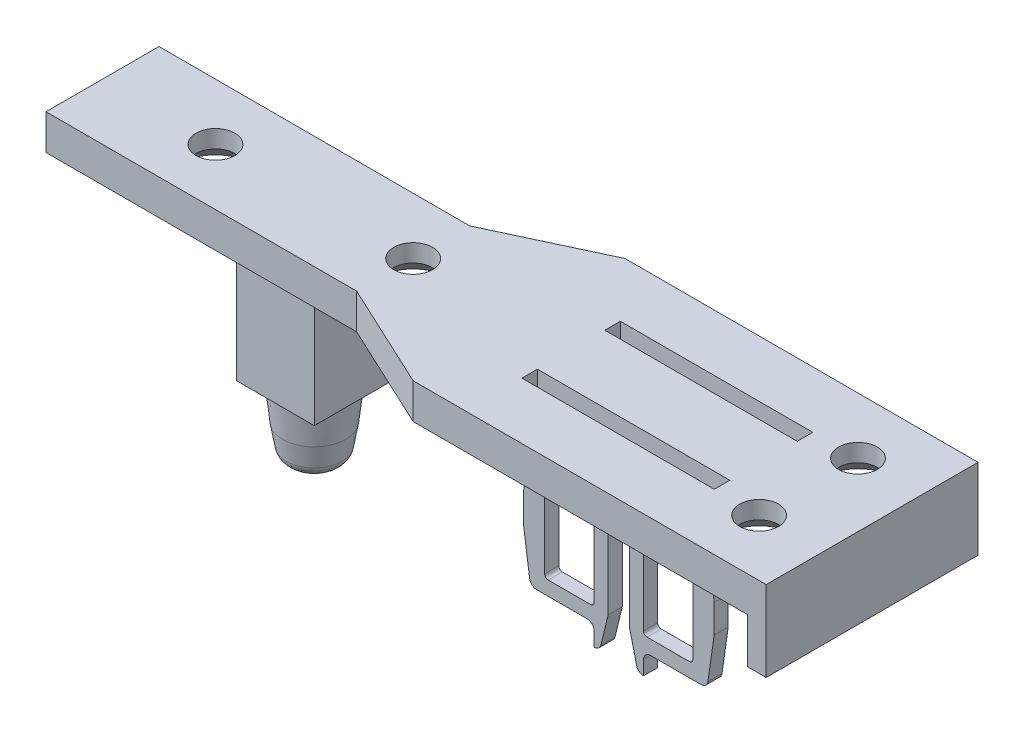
ISO-10303-21;
HEADER;
FILE_DESCRIPTION(('STEP AP214'),'2;1');
FILE_NAME('part.step','',(''),(''),'','','');
FILE_SCHEMA(('AUTOMOTIVE_DESIGN { 1 0 10303 214 1 1 1 1 }'));
ENDSEC;
DATA;
#1=APPLICATION_CONTEXT('core data for automotive mechanical design processes');
#2=APPLICATION_PROTOCOL_DEFINITION('international standard','automotive_design',2000,#1);
#3=PRODUCT_CONTEXT('',#1,'mechanical');
#4=PRODUCT('Part','Part','',(#3));
#5=PRODUCT_RELATED_PRODUCT_CATEGORY('part','',(#4));
#6=PRODUCT_DEFINITION_FORMATION('','',#4);
#7=PRODUCT_DEFINITION_CONTEXT('part definition',#1,'design');
#8=PRODUCT_DEFINITION('design','',#6,#7);
#9=PRODUCT_DEFINITION_SHAPE('','',#8);
#10=(LENGTH_UNIT() NAMED_UNIT(*) SI_UNIT(.MILLI.,.METRE.));
#11=(NAMED_UNIT(*) PLANE_ANGLE_UNIT() SI_UNIT($,.RADIAN.));
#12=(NAMED_UNIT(*) SI_UNIT($,.STERADIAN.) SOLID_ANGLE_UNIT());
#13=UNCERTAINTY_MEASURE_WITH_UNIT(LENGTH_MEASURE(1.E-05),#10,'distance_accuracy_value','');
#14=(GEOMETRIC_REPRESENTATION_CONTEXT(3) GLOBAL_UNCERTAINTY_ASSIGNED_CONTEXT((#13)) GLOBAL_UNIT_ASSIGNED_CONTEXT((#10,
#11,#12)) REPRESENTATION_CONTEXT('',''));
#15=CARTESIAN_POINT('',(0.,0.,0.));
#16=DIRECTION('',(0.,0.,1.));
#17=DIRECTION('',(1.,0.,0.));
#18=AXIS2_PLACEMENT_3D('',#15,#16,#17);
#19=CARTESIAN_POINT('',(-11.6327,-29.0855785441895,0.));
#20=DIRECTION('',(0.,0.,1.));
#21=DIRECTION('',(1.,0.,0.));
#22=AXIS2_PLACEMENT_3D('',#19,#20,#21);
#23=CYLINDRICAL_SURFACE('',#22,0.999999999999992);
#24=CARTESIAN_POINT('',(-11.6327,-29.0855785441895,-1.));
#25=DIRECTION('',(0.,0.,1.));
#26=DIRECTION('',(1.,0.,0.));
#27=AXIS2_PLACEMENT_3D('',#24,#25,#26);
#28=CIRCLE('',#27,0.999999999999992);
#29=CARTESIAN_POINT('',(-12.6226493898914,-29.2270006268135,-1.));
#30=VERTEX_POINT('',#29);
#31=CARTESIAN_POINT('',(-11.6327,-30.0855785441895,-1.));
#32=VERTEX_POINT('',#31);
#33=EDGE_CURVE('P0_E19',#30,#32,#28,.T.);
#34=ORIENTED_EDGE('',*,*,#33,.T.);
#35=DIRECTION('',(0.,0.,-1.));
#36=VECTOR('',#35,1.);
#37=CARTESIAN_POINT('',(-11.6327,-30.0855785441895,0.));
#38=LINE('',#37,#36);
#39=CARTESIAN_POINT('',(-11.6327,-30.0855785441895,1.));
#40=VERTEX_POINT('',#39);
#41=EDGE_CURVE('P0_E245',#40,#32,#38,.T.);
#42=ORIENTED_EDGE('',*,*,#41,.F.);
#43=CARTESIAN_POINT('',(-11.6327,-29.0855785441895,1.));
#44=DIRECTION('',(0.,0.,1.));
#45=DIRECTION('',(1.,0.,0.));
#46=AXIS2_PLACEMENT_3D('',#43,#44,#45);
#47=CIRCLE('',#46,0.999999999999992);
#48=CARTESIAN_POINT('',(-12.6226493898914,-29.2270006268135,1.));
#49=VERTEX_POINT('',#48);
#50=EDGE_CURVE('P0_E241',#49,#40,#47,.T.);
#51=ORIENTED_EDGE('',*,*,#50,.F.);
#52=DIRECTION('',(0.,0.,1.));
#53=VECTOR('',#52,1.);
#54=CARTESIAN_POINT('',(-12.6226493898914,-29.2270006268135,0.));
#55=LINE('',#54,#53);
#56=EDGE_CURVE('P0_E243',#30,#49,#55,.T.);
#57=ORIENTED_EDGE('',*,*,#56,.F.);
#58=EDGE_LOOP('',(#34,#42,#51,#57));
#59=FACE_BOUND('',#58,.T.);
#60=ADVANCED_FACE('P0_F16',(#59),#23,.T.);
#61=CARTESIAN_POINT('',(-4.5,-31.0855785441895,0.));
#62=DIRECTION('',(0.,0.,1.));
#63=DIRECTION('',(1.,0.,0.));
#64=AXIS2_PLACEMENT_3D('',#61,#62,#63);
#65=CYLINDRICAL_SURFACE('',#64,1.00000000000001);
#66=DIRECTION('',(0.,0.,-1.));
#67=VECTOR('',#66,1.);
#68=CARTESIAN_POINT('',(-4.5,-30.0855785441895,0.));
#69=LINE('',#68,#67);
#70=CARTESIAN_POINT('',(-4.5,-30.0855785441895,-1.));
#71=VERTEX_POINT('',#70);
#72=CARTESIAN_POINT('',(-4.5,-30.0855785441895,1.));
#73=VERTEX_POINT('',#72);
#74=EDGE_CURVE('P0_E333',#71,#73,#69,.F.);
#75=ORIENTED_EDGE('',*,*,#74,.F.);
#76=CARTESIAN_POINT('',(-4.5,-31.0855785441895,-1.));
#77=DIRECTION('',(0.,0.,1.));
#78=DIRECTION('',(1.,0.,0.));
#79=AXIS2_PLACEMENT_3D('',#76,#77,#78);
#80=CIRCLE('',#79,1.00000000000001);
#81=CARTESIAN_POINT('',(-3.5,-31.0855785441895,-1.));
#82=VERTEX_POINT('',#81);
#83=EDGE_CURVE('P0_E325',#82,#71,#80,.T.);
#84=ORIENTED_EDGE('',*,*,#83,.F.);
#85=DIRECTION('',(0.,0.,1.));
#86=VECTOR('',#85,1.);
#87=CARTESIAN_POINT('',(-3.5,-31.0855785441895,0.));
#88=LINE('',#87,#86);
#89=CARTESIAN_POINT('',(-3.5,-31.0855785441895,1.));
#90=VERTEX_POINT('',#89);
#91=EDGE_CURVE('P0_E448',#90,#82,#88,.F.);
#92=ORIENTED_EDGE('',*,*,#91,.F.);
#93=CARTESIAN_POINT('',(-4.5,-31.0855785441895,1.));
#94=DIRECTION('',(0.,0.,1.));
#95=DIRECTION('',(1.,0.,0.));
#96=AXIS2_PLACEMENT_3D('',#93,#94,#95);
#97=CIRCLE('',#96,1.00000000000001);
#98=EDGE_CURVE('P0_E250',#73,#90,#97,.F.);
#99=ORIENTED_EDGE('',*,*,#98,.F.);
#100=EDGE_LOOP('',(#75,#84,#92,#99));
#101=FACE_BOUND('',#100,.T.);
#102=ADVANCED_FACE('P0_F519',(#101),#65,.F.);
#103=CARTESIAN_POINT('',(-3.5,-32.0855785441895,0.));
#104=DIRECTION('',(0.,0.,1.));
#105=DIRECTION('',(1.,0.,0.));
#106=AXIS2_PLACEMENT_3D('',#103,#104,#105);
#107=CYLINDRICAL_SURFACE('',#106,1.);
#108=CARTESIAN_POINT('',(-3.5,-32.0855785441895,-1.));
#109=DIRECTION('',(0.,0.,1.));
#110=DIRECTION('',(1.,0.,0.));
#111=AXIS2_PLACEMENT_3D('',#108,#109,#110);
#112=CIRCLE('',#111,1.);
#113=CARTESIAN_POINT('',(-3.5,-33.0855785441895,-1.));
#114=VERTEX_POINT('',#113);
#115=CARTESIAN_POINT('',(-2.52822021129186,-32.3214684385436,-1.));
#116=VERTEX_POINT('',#115);
#117=EDGE_CURVE('P0_E324',#114,#116,#112,.T.);
#118=ORIENTED_EDGE('',*,*,#117,.T.);
#119=DIRECTION('',(0.,0.,1.));
#120=VECTOR('',#119,1.);
#121=CARTESIAN_POINT('',(-2.52822021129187,-32.3214684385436,0.));
#122=LINE('',#121,#120);
#123=CARTESIAN_POINT('',(-2.52822021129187,-32.3214684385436,1.));
#124=VERTEX_POINT('',#123);
#125=EDGE_CURVE('P0_E444',#124,#116,#122,.F.);
#126=ORIENTED_EDGE('',*,*,#125,.F.);
#127=CARTESIAN_POINT('',(-3.5,-32.0855785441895,1.));
#128=DIRECTION('',(0.,0.,1.));
#129=DIRECTION('',(1.,0.,0.));
#130=AXIS2_PLACEMENT_3D('',#127,#128,#129);
#131=CIRCLE('',#130,1.);
#132=CARTESIAN_POINT('',(-3.5,-33.0855785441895,1.));
#133=VERTEX_POINT('',#132);
#134=EDGE_CURVE('P0_E300',#133,#124,#131,.T.);
#135=ORIENTED_EDGE('',*,*,#134,.F.);
#136=DIRECTION('',(0.,0.,1.));
#137=VECTOR('',#136,1.);
#138=CARTESIAN_POINT('',(-3.5,-33.0855785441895,0.));
#139=LINE('',#138,#137);
#140=EDGE_CURVE('P0_E451',#114,#133,#139,.T.);
#141=ORIENTED_EDGE('',*,*,#140,.F.);
#142=EDGE_LOOP('',(#118,#126,#135,#141));
#143=FACE_BOUND('',#142,.T.);
#144=ADVANCED_FACE('P0_F521',(#143),#107,.T.);
#145=CARTESIAN_POINT('',(3.5,-32.0855785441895,0.));
#146=DIRECTION('',(0.,0.,1.));
#147=DIRECTION('',(1.,0.,0.));
#148=AXIS2_PLACEMENT_3D('',#145,#146,#147);
#149=CYLINDRICAL_SURFACE('',#148,1.);
#150=CARTESIAN_POINT('',(3.5,-32.0855785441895,-1.));
#151=DIRECTION('',(0.,0.,1.));
#152=DIRECTION('',(1.,0.,0.));
#153=AXIS2_PLACEMENT_3D('',#150,#151,#152);
#154=CIRCLE('',#153,1.);
#155=CARTESIAN_POINT('',(2.52822021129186,-32.3214684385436,-1.));
#156=VERTEX_POINT('',#155);
#157=CARTESIAN_POINT('',(3.5,-33.0855785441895,-1.));
#158=VERTEX_POINT('',#157);
#159=EDGE_CURVE('P0_E322',#156,#158,#154,.T.);
#160=ORIENTED_EDGE('',*,*,#159,.T.);
#161=DIRECTION('',(0.,0.,-1.));
#162=VECTOR('',#161,1.);
#163=CARTESIAN_POINT('',(3.5,-33.0855785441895,0.));
#164=LINE('',#163,#162);
#165=CARTESIAN_POINT('',(3.5,-33.0855785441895,1.));
#166=VERTEX_POINT('',#165);
#167=EDGE_CURVE('P0_E422',#166,#158,#164,.T.);
#168=ORIENTED_EDGE('',*,*,#167,.F.);
#169=CARTESIAN_POINT('',(3.5,-32.0855785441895,1.));
#170=DIRECTION('',(0.,0.,1.));
#171=DIRECTION('',(1.,0.,0.));
#172=AXIS2_PLACEMENT_3D('',#169,#170,#171);
#173=CIRCLE('',#172,1.);
#174=CARTESIAN_POINT('',(2.52822021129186,-32.3214684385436,1.));
#175=VERTEX_POINT('',#174);
#176=EDGE_CURVE('P0_E298',#175,#166,#173,.T.);
#177=ORIENTED_EDGE('',*,*,#176,.F.);
#178=DIRECTION('',(0.,0.,1.));
#179=VECTOR('',#178,1.);
#180=CARTESIAN_POINT('',(2.52822021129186,-32.3214684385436,0.));
#181=LINE('',#180,#179);
#182=EDGE_CURVE('P0_E429',#156,#175,#181,.T.);
#183=ORIENTED_EDGE('',*,*,#182,.F.);
#184=EDGE_LOOP('',(#160,#168,#177,#183));
#185=FACE_BOUND('',#184,.T.);
#186=ADVANCED_FACE('P0_F527',(#185),#149,.T.);
#187=CARTESIAN_POINT('',(4.5,-31.0855785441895,0.));
#188=DIRECTION('',(0.,0.,1.));
#189=DIRECTION('',(1.,0.,0.));
#190=AXIS2_PLACEMENT_3D('',#187,#188,#189);
#191=CYLINDRICAL_SURFACE('',#190,1.00000000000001);
#192=DIRECTION('',(0.,0.,-1.));
#193=VECTOR('',#192,1.);
#194=CARTESIAN_POINT('',(3.5,-31.0855785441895,0.));
#195=LINE('',#194,#193);
#196=CARTESIAN_POINT('',(3.5,-31.0855785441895,-1.));
#197=VERTEX_POINT('',#196);
#198=CARTESIAN_POINT('',(3.5,-31.0855785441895,1.));
#199=VERTEX_POINT('',#198);
#200=EDGE_CURVE('P0_E425',#197,#199,#195,.F.);
#201=ORIENTED_EDGE('',*,*,#200,.F.);
#202=CARTESIAN_POINT('',(4.5,-31.0855785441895,-1.));
#203=DIRECTION('',(0.,0.,1.));
#204=DIRECTION('',(1.,0.,0.));
#205=AXIS2_PLACEMENT_3D('',#202,#203,#204);
#206=CIRCLE('',#205,1.00000000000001);
#207=CARTESIAN_POINT('',(4.5,-30.0855785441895,-1.));
#208=VERTEX_POINT('',#207);
#209=EDGE_CURVE('P0_E320',#208,#197,#206,.T.);
#210=ORIENTED_EDGE('',*,*,#209,.F.);
#211=DIRECTION('',(0.,0.,-1.));
#212=VECTOR('',#211,1.);
#213=CARTESIAN_POINT('',(4.5,-30.0855785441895,0.));
#214=LINE('',#213,#212);
#215=CARTESIAN_POINT('',(4.5,-30.0855785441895,1.));
#216=VERTEX_POINT('',#215);
#217=EDGE_CURVE('P0_E415',#216,#208,#214,.T.);
#218=ORIENTED_EDGE('',*,*,#217,.F.);
#219=CARTESIAN_POINT('',(4.5,-31.0855785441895,1.));
#220=DIRECTION('',(0.,0.,1.));
#221=DIRECTION('',(1.,0.,0.));
#222=AXIS2_PLACEMENT_3D('',#219,#220,#221);
#223=CIRCLE('',#222,1.00000000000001);
#224=EDGE_CURVE('P0_E296',#199,#216,#223,.F.);
#225=ORIENTED_EDGE('',*,*,#224,.F.);
#226=EDGE_LOOP('',(#201,#210,#218,#225));
#227=FACE_BOUND('',#226,.T.);
#228=ADVANCED_FACE('P0_F664',(#227),#191,.F.);
#229=CARTESIAN_POINT('',(11.6327,-29.0855785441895,0.));
#230=DIRECTION('',(0.,0.,1.));
#231=DIRECTION('',(1.,0.,0.));
#232=AXIS2_PLACEMENT_3D('',#229,#230,#231);
#233=CYLINDRICAL_SURFACE('',#232,0.999999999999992);
#234=CARTESIAN_POINT('',(11.6327,-29.0855785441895,-1.));
#235=DIRECTION('',(0.,0.,1.));
#236=DIRECTION('',(1.,0.,0.));
#237=AXIS2_PLACEMENT_3D('',#234,#235,#236);
#238=CIRCLE('',#237,0.999999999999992);
#239=CARTESIAN_POINT('',(11.6327,-30.0855785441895,-1.));
#240=VERTEX_POINT('',#239);
#241=CARTESIAN_POINT('',(12.6226493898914,-29.2270006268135,-1.));
#242=VERTEX_POINT('',#241);
#243=EDGE_CURVE('P0_E318',#240,#242,#238,.T.);
#244=ORIENTED_EDGE('',*,*,#243,.T.);
#245=DIRECTION('',(0.,0.,1.));
#246=VECTOR('',#245,1.);
#247=CARTESIAN_POINT('',(12.6226493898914,-29.2270006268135,0.));
#248=LINE('',#247,#246);
#249=CARTESIAN_POINT('',(12.6226493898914,-29.2270006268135,1.));
#250=VERTEX_POINT('',#249);
#251=EDGE_CURVE('P0_E401',#250,#242,#248,.F.);
#252=ORIENTED_EDGE('',*,*,#251,.F.);
#253=CARTESIAN_POINT('',(11.6327,-29.0855785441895,1.));
#254=DIRECTION('',(0.,0.,1.));
#255=DIRECTION('',(1.,0.,0.));
#256=AXIS2_PLACEMENT_3D('',#253,#254,#255);
#257=CIRCLE('',#256,0.999999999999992);
#258=CARTESIAN_POINT('',(11.6327,-30.0855785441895,1.));
#259=VERTEX_POINT('',#258);
#260=EDGE_CURVE('P0_E294',#259,#250,#257,.T.);
#261=ORIENTED_EDGE('',*,*,#260,.F.);
#262=DIRECTION('',(0.,0.,-1.));
#263=VECTOR('',#262,1.);
#264=CARTESIAN_POINT('',(11.6327,-30.0855785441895,0.));
#265=LINE('',#264,#263);
#266=EDGE_CURVE('P0_E418',#240,#259,#265,.F.);
#267=ORIENTED_EDGE('',*,*,#266,.F.);
#268=EDGE_LOOP('',(#244,#252,#261,#267));
#269=FACE_BOUND('',#268,.T.);
#270=ADVANCED_FACE('P0_F660',(#269),#233,.T.);
#271=CARTESIAN_POINT('',(4.,-14.5855785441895,0.));
#272=DIRECTION('',(0.,0.,1.));
#273=DIRECTION('',(1.,0.,0.));
#274=AXIS2_PLACEMENT_3D('',#271,#272,#273);
#275=CYLINDRICAL_SURFACE('',#274,0.500000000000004);
#276=DIRECTION('',(0.,0.,1.));
#277=VECTOR('',#276,1.);
#278=CARTESIAN_POINT('',(3.5,-14.5855785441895,0.));
#279=LINE('',#278,#277);
#280=CARTESIAN_POINT('',(3.5,-14.5855785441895,1.));
#281=VERTEX_POINT('',#280);
#282=CARTESIAN_POINT('',(3.5,-14.5855785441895,-1.));
#283=VERTEX_POINT('',#282);
#284=EDGE_CURVE('P0_E397',#281,#283,#279,.F.);
#285=ORIENTED_EDGE('',*,*,#284,.T.);
#286=CARTESIAN_POINT('',(4.,-14.5855785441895,-1.));
#287=DIRECTION('',(0.,0.,1.));
#288=DIRECTION('',(1.,0.,0.));
#289=AXIS2_PLACEMENT_3D('',#286,#287,#288);
#290=CIRCLE('',#289,0.500000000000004);
#291=CARTESIAN_POINT('',(4.,-14.0855785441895,-1.));
#292=VERTEX_POINT('',#291);
#293=EDGE_CURVE('P0_E316',#292,#283,#290,.T.);
#294=ORIENTED_EDGE('',*,*,#293,.F.);
#295=DIRECTION('',(0.,0.,1.));
#296=VECTOR('',#295,1.);
#297=CARTESIAN_POINT('',(4.,-14.0855785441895,0.));
#298=LINE('',#297,#296);
#299=CARTESIAN_POINT('',(4.,-14.0855785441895,1.));
#300=VERTEX_POINT('',#299);
#301=EDGE_CURVE('P0_E387',#292,#300,#298,.T.);
#302=ORIENTED_EDGE('',*,*,#301,.T.);
#303=CARTESIAN_POINT('',(4.,-14.5855785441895,1.));
#304=DIRECTION('',(0.,0.,1.));
#305=DIRECTION('',(1.,0.,0.));
#306=AXIS2_PLACEMENT_3D('',#303,#304,#305);
#307=CIRCLE('',#306,0.500000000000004);
#308=EDGE_CURVE('P0_E290',#281,#300,#307,.F.);
#309=ORIENTED_EDGE('',*,*,#308,.F.);
#310=EDGE_LOOP('',(#285,#294,#302,#309));
#311=FACE_BOUND('',#310,.T.);
#312=ADVANCED_FACE('P0_F656',(#311),#275,.F.);
#313=CARTESIAN_POINT('',(10.,-14.5855785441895,0.));
#314=DIRECTION('',(0.,0.,1.));
#315=DIRECTION('',(1.,0.,0.));
#316=AXIS2_PLACEMENT_3D('',#313,#314,#315);
#317=CYLINDRICAL_SURFACE('',#316,0.500000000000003);
#318=DIRECTION('',(0.,0.,1.));
#319=VECTOR('',#318,1.);
#320=CARTESIAN_POINT('',(10.,-14.0855785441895,0.));
#321=LINE('',#320,#319);
#322=CARTESIAN_POINT('',(10.,-14.0855785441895,1.));
#323=VERTEX_POINT('',#322);
#324=CARTESIAN_POINT('',(10.,-14.0855785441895,-1.));
#325=VERTEX_POINT('',#324);
#326=EDGE_CURVE('P0_E390',#323,#325,#321,.F.);
#327=ORIENTED_EDGE('',*,*,#326,.T.);
#328=CARTESIAN_POINT('',(10.,-14.5855785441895,-1.));
#329=DIRECTION('',(0.,0.,1.));
#330=DIRECTION('',(1.,0.,0.));
#331=AXIS2_PLACEMENT_3D('',#328,#329,#330);
#332=CIRCLE('',#331,0.500000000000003);
#333=CARTESIAN_POINT('',(10.5,-14.5855785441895,-1.));
#334=VERTEX_POINT('',#333);
#335=EDGE_CURVE('P0_E314',#334,#325,#332,.T.);
#336=ORIENTED_EDGE('',*,*,#335,.F.);
#337=DIRECTION('',(0.,0.,-1.));
#338=VECTOR('',#337,1.);
#339=CARTESIAN_POINT('',(10.5,-14.5855785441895,0.));
#340=LINE('',#339,#338);
#341=CARTESIAN_POINT('',(10.5,-14.5855785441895,1.));
#342=VERTEX_POINT('',#341);
#343=EDGE_CURVE('P0_E380',#334,#342,#340,.F.);
#344=ORIENTED_EDGE('',*,*,#343,.T.);
#345=CARTESIAN_POINT('',(10.,-14.5855785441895,1.));
#346=DIRECTION('',(0.,0.,1.));
#347=DIRECTION('',(1.,0.,0.));
#348=AXIS2_PLACEMENT_3D('',#345,#346,#347);
#349=CIRCLE('',#348,0.500000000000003);
#350=EDGE_CURVE('P0_E288',#323,#342,#349,.F.);
#351=ORIENTED_EDGE('',*,*,#350,.F.);
#352=EDGE_LOOP('',(#327,#336,#344,#351));
#353=FACE_BOUND('',#352,.T.);
#354=ADVANCED_FACE('P0_F652',(#353),#317,.F.);
#355=CARTESIAN_POINT('',(4.,-27.5855785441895,0.));
#356=DIRECTION('',(0.,0.,1.));
#357=DIRECTION('',(1.,0.,0.));
#358=AXIS2_PLACEMENT_3D('',#355,#356,#357);
#359=CYLINDRICAL_SURFACE('',#358,0.499999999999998);
#360=DIRECTION('',(0.,0.,-1.));
#361=VECTOR('',#360,1.);
#362=CARTESIAN_POINT('',(4.,-28.0855785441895,0.));
#363=LINE('',#362,#361);
#364=CARTESIAN_POINT('',(4.,-28.0855785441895,1.));
#365=VERTEX_POINT('',#364);
#366=CARTESIAN_POINT('',(4.,-28.0855785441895,-1.));
#367=VERTEX_POINT('',#366);
#368=EDGE_CURVE('P0_E376',#365,#367,#363,.T.);
#369=ORIENTED_EDGE('',*,*,#368,.T.);
#370=CARTESIAN_POINT('',(4.,-27.5855785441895,-1.));
#371=DIRECTION('',(0.,0.,1.));
#372=DIRECTION('',(1.,0.,0.));
#373=AXIS2_PLACEMENT_3D('',#370,#371,#372);
#374=CIRCLE('',#373,0.499999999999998);
#375=CARTESIAN_POINT('',(3.5,-27.5855785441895,-1.));
#376=VERTEX_POINT('',#375);
#377=EDGE_CURVE('P0_E312',#376,#367,#374,.T.);
#378=ORIENTED_EDGE('',*,*,#377,.F.);
#379=DIRECTION('',(0.,0.,1.));
#380=VECTOR('',#379,1.);
#381=CARTESIAN_POINT('',(3.5,-27.5855785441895,0.));
#382=LINE('',#381,#380);
#383=CARTESIAN_POINT('',(3.5,-27.5855785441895,1.));
#384=VERTEX_POINT('',#383);
#385=EDGE_CURVE('P0_E394',#376,#384,#382,.T.);
#386=ORIENTED_EDGE('',*,*,#385,.T.);
#387=CARTESIAN_POINT('',(4.,-27.5855785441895,1.));
#388=DIRECTION('',(0.,0.,1.));
#389=DIRECTION('',(1.,0.,0.));
#390=AXIS2_PLACEMENT_3D('',#387,#388,#389);
#391=CIRCLE('',#390,0.499999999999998);
#392=EDGE_CURVE('P0_E292',#365,#384,#391,.F.);
#393=ORIENTED_EDGE('',*,*,#392,.F.);
#394=EDGE_LOOP('',(#369,#378,#386,#393));
#395=FACE_BOUND('',#394,.T.);
#396=ADVANCED_FACE('P0_F648',(#395),#359,.F.);
#397=CARTESIAN_POINT('',(10.,-27.5855785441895,0.));
#398=DIRECTION('',(0.,0.,1.));
#399=DIRECTION('',(1.,0.,0.));
#400=AXIS2_PLACEMENT_3D('',#397,#398,#399);
#401=CYLINDRICAL_SURFACE('',#400,0.499999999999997);
#402=DIRECTION('',(0.,0.,-1.));
#403=VECTOR('',#402,1.);
#404=CARTESIAN_POINT('',(10.5,-27.5855785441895,0.));
#405=LINE('',#404,#403);
#406=CARTESIAN_POINT('',(10.5,-27.5855785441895,1.));
#407=VERTEX_POINT('',#406);
#408=CARTESIAN_POINT('',(10.5,-27.5855785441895,-1.));
#409=VERTEX_POINT('',#408);
#410=EDGE_CURVE('P0_E383',#407,#409,#405,.T.);
#411=ORIENTED_EDGE('',*,*,#410,.T.);
#412=CARTESIAN_POINT('',(10.,-27.5855785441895,-1.));
#413=DIRECTION('',(0.,0.,1.));
#414=DIRECTION('',(1.,0.,0.));
#415=AXIS2_PLACEMENT_3D('',#412,#413,#414);
#416=CIRCLE('',#415,0.499999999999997);
#417=CARTESIAN_POINT('',(10.,-28.0855785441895,-1.));
#418=VERTEX_POINT('',#417);
#419=EDGE_CURVE('P0_E310',#418,#409,#416,.T.);
#420=ORIENTED_EDGE('',*,*,#419,.F.);
#421=DIRECTION('',(0.,0.,-1.));
#422=VECTOR('',#421,1.);
#423=CARTESIAN_POINT('',(10.,-28.0855785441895,0.));
#424=LINE('',#423,#422);
#425=CARTESIAN_POINT('',(10.,-28.0855785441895,1.));
#426=VERTEX_POINT('',#425);
#427=EDGE_CURVE('P0_E373',#418,#426,#424,.F.);
#428=ORIENTED_EDGE('',*,*,#427,.T.);
#429=CARTESIAN_POINT('',(10.,-27.5855785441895,1.));
#430=DIRECTION('',(0.,0.,1.));
#431=DIRECTION('',(1.,0.,0.));
#432=AXIS2_PLACEMENT_3D('',#429,#430,#431);
#433=CIRCLE('',#432,0.499999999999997);
#434=EDGE_CURVE('P0_E286',#407,#426,#433,.F.);
#435=ORIENTED_EDGE('',*,*,#434,.F.);
#436=EDGE_LOOP('',(#411,#420,#428,#435));
#437=FACE_BOUND('',#436,.T.);
#438=ADVANCED_FACE('P0_F644',(#437),#401,.F.);
#439=CARTESIAN_POINT('',(-4.,-27.5855785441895,0.));
#440=DIRECTION('',(0.,0.,1.));
#441=DIRECTION('',(1.,0.,0.));
#442=AXIS2_PLACEMENT_3D('',#439,#440,#441);
#443=CYLINDRICAL_SURFACE('',#442,0.499999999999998);
#444=DIRECTION('',(0.,0.,-1.));
#445=VECTOR('',#444,1.);
#446=CARTESIAN_POINT('',(-3.5,-27.5855785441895,0.));
#447=LINE('',#446,#445);
#448=CARTESIAN_POINT('',(-3.5,-27.5855785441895,1.));
#449=VERTEX_POINT('',#448);
#450=CARTESIAN_POINT('',(-3.5,-27.5855785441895,-1.));
#451=VERTEX_POINT('',#450);
#452=EDGE_CURVE('P0_E369',#449,#451,#447,.T.);
#453=ORIENTED_EDGE('',*,*,#452,.T.);
#454=CARTESIAN_POINT('',(-4.,-27.5855785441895,-1.));
#455=DIRECTION('',(0.,0.,1.));
#456=DIRECTION('',(1.,0.,0.));
#457=AXIS2_PLACEMENT_3D('',#454,#455,#456);
#458=CIRCLE('',#457,0.499999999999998);
#459=CARTESIAN_POINT('',(-4.,-28.0855785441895,-1.));
#460=VERTEX_POINT('',#459);
#461=EDGE_CURVE('P0_E308',#460,#451,#458,.T.);
#462=ORIENTED_EDGE('',*,*,#461,.F.);
#463=DIRECTION('',(0.,0.,-1.));
#464=VECTOR('',#463,1.);
#465=CARTESIAN_POINT('',(-4.,-28.0855785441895,0.));
#466=LINE('',#465,#464);
#467=CARTESIAN_POINT('',(-4.,-28.0855785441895,1.));
#468=VERTEX_POINT('',#467);
#469=EDGE_CURVE('P0_E359',#460,#468,#466,.F.);
#470=ORIENTED_EDGE('',*,*,#469,.T.);
#471=CARTESIAN_POINT('',(-4.,-27.5855785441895,1.));
#472=DIRECTION('',(0.,0.,1.));
#473=DIRECTION('',(1.,0.,0.));
#474=AXIS2_PLACEMENT_3D('',#471,#472,#473);
#475=CIRCLE('',#474,0.499999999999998);
#476=EDGE_CURVE('P0_E282',#449,#468,#475,.F.);
#477=ORIENTED_EDGE('',*,*,#476,.F.);
#478=EDGE_LOOP('',(#453,#462,#470,#477));
#479=FACE_BOUND('',#478,.T.);
#480=ADVANCED_FACE('P0_F640',(#479),#443,.F.);
#481=CARTESIAN_POINT('',(-10.,-27.5855785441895,0.));
#482=DIRECTION('',(0.,0.,1.));
#483=DIRECTION('',(1.,0.,0.));
#484=AXIS2_PLACEMENT_3D('',#481,#482,#483);
#485=CYLINDRICAL_SURFACE('',#484,0.499999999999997);
#486=DIRECTION('',(0.,0.,-1.));
#487=VECTOR('',#486,1.);
#488=CARTESIAN_POINT('',(-10.,-28.0855785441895,0.));
#489=LINE('',#488,#487);
#490=CARTESIAN_POINT('',(-10.,-28.0855785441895,1.));
#491=VERTEX_POINT('',#490);
#492=CARTESIAN_POINT('',(-10.,-28.0855785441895,-1.));
#493=VERTEX_POINT('',#492);
#494=EDGE_CURVE('P0_E362',#491,#493,#489,.T.);
#495=ORIENTED_EDGE('',*,*,#494,.T.);
#496=CARTESIAN_POINT('',(-10.,-27.5855785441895,-1.));
#497=DIRECTION('',(0.,0.,1.));
#498=DIRECTION('',(1.,0.,0.));
#499=AXIS2_PLACEMENT_3D('',#496,#497,#498);
#500=CIRCLE('',#499,0.499999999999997);
#501=CARTESIAN_POINT('',(-10.5,-27.5855785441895,-1.));
#502=VERTEX_POINT('',#501);
#503=EDGE_CURVE('P0_E306',#502,#493,#500,.T.);
#504=ORIENTED_EDGE('',*,*,#503,.F.);
#505=DIRECTION('',(0.,0.,1.));
#506=VECTOR('',#505,1.);
#507=CARTESIAN_POINT('',(-10.5,-27.5855785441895,0.));
#508=LINE('',#507,#506);
#509=CARTESIAN_POINT('',(-10.5,-27.5855785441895,1.));
#510=VERTEX_POINT('',#509);
#511=EDGE_CURVE('P0_E353',#502,#510,#508,.T.);
#512=ORIENTED_EDGE('',*,*,#511,.T.);
#513=CARTESIAN_POINT('',(-10.,-27.5855785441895,1.));
#514=DIRECTION('',(0.,0.,1.));
#515=DIRECTION('',(1.,0.,0.));
#516=AXIS2_PLACEMENT_3D('',#513,#514,#515);
#517=CIRCLE('',#516,0.499999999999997);
#518=EDGE_CURVE('P0_E280',#491,#510,#517,.F.);
#519=ORIENTED_EDGE('',*,*,#518,.F.);
#520=EDGE_LOOP('',(#495,#504,#512,#519));
#521=FACE_BOUND('',#520,.T.);
#522=ADVANCED_FACE('P0_F636',(#521),#485,.F.);
#523=CARTESIAN_POINT('',(-4.,-14.5855785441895,0.));
#524=DIRECTION('',(0.,0.,1.));
#525=DIRECTION('',(1.,0.,0.));
#526=AXIS2_PLACEMENT_3D('',#523,#524,#525);
#527=CYLINDRICAL_SURFACE('',#526,0.500000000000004);
#528=DIRECTION('',(0.,0.,1.));
#529=VECTOR('',#528,1.);
#530=CARTESIAN_POINT('',(-4.,-14.0855785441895,0.));
#531=LINE('',#530,#529);
#532=CARTESIAN_POINT('',(-4.,-14.0855785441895,1.));
#533=VERTEX_POINT('',#532);
#534=CARTESIAN_POINT('',(-4.,-14.0855785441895,-1.));
#535=VERTEX_POINT('',#534);
#536=EDGE_CURVE('P0_E349',#533,#535,#531,.F.);
#537=ORIENTED_EDGE('',*,*,#536,.T.);
#538=CARTESIAN_POINT('',(-4.,-14.5855785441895,-1.));
#539=DIRECTION('',(0.,0.,1.));
#540=DIRECTION('',(1.,0.,0.));
#541=AXIS2_PLACEMENT_3D('',#538,#539,#540);
#542=CIRCLE('',#541,0.500000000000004);
#543=CARTESIAN_POINT('',(-3.5,-14.5855785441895,-1.));
#544=VERTEX_POINT('',#543);
#545=EDGE_CURVE('P0_E304',#544,#535,#542,.T.);
#546=ORIENTED_EDGE('',*,*,#545,.F.);
#547=DIRECTION('',(0.,0.,-1.));
#548=VECTOR('',#547,1.);
#549=CARTESIAN_POINT('',(-3.5,-14.5855785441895,0.));
#550=LINE('',#549,#548);
#551=CARTESIAN_POINT('',(-3.5,-14.5855785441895,1.));
#552=VERTEX_POINT('',#551);
#553=EDGE_CURVE('P0_E366',#544,#552,#550,.F.);
#554=ORIENTED_EDGE('',*,*,#553,.T.);
#555=CARTESIAN_POINT('',(-4.,-14.5855785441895,1.));
#556=DIRECTION('',(0.,0.,1.));
#557=DIRECTION('',(1.,0.,0.));
#558=AXIS2_PLACEMENT_3D('',#555,#556,#557);
#559=CIRCLE('',#558,0.500000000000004);
#560=EDGE_CURVE('P0_E284',#533,#552,#559,.F.);
#561=ORIENTED_EDGE('',*,*,#560,.F.);
#562=EDGE_LOOP('',(#537,#546,#554,#561));
#563=FACE_BOUND('',#562,.T.);
#564=ADVANCED_FACE('P0_F633',(#563),#527,.F.);
#565=CARTESIAN_POINT('',(-10.,-14.5855785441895,0.));
#566=DIRECTION('',(0.,0.,1.));
#567=DIRECTION('',(1.,0.,0.));
#568=AXIS2_PLACEMENT_3D('',#565,#566,#567);
#569=CYLINDRICAL_SURFACE('',#568,0.500000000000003);
#570=DIRECTION('',(0.,0.,1.));
#571=VECTOR('',#570,1.);
#572=CARTESIAN_POINT('',(-10.5,-14.5855785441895,0.));
#573=LINE('',#572,#571);
#574=CARTESIAN_POINT('',(-10.5,-14.5855785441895,1.));
#575=VERTEX_POINT('',#574);
#576=CARTESIAN_POINT('',(-10.5,-14.5855785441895,-1.));
#577=VERTEX_POINT('',#576);
#578=EDGE_CURVE('P0_E356',#575,#577,#573,.F.);
#579=ORIENTED_EDGE('',*,*,#578,.T.);
#580=CARTESIAN_POINT('',(-10.,-14.5855785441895,-1.));
#581=DIRECTION('',(0.,0.,1.));
#582=DIRECTION('',(1.,0.,0.));
#583=AXIS2_PLACEMENT_3D('',#580,#581,#582);
#584=CIRCLE('',#583,0.500000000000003);
#585=CARTESIAN_POINT('',(-10.,-14.0855785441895,-1.));
#586=VERTEX_POINT('',#585);
#587=EDGE_CURVE('P0_E34',#586,#577,#584,.T.);
#588=ORIENTED_EDGE('',*,*,#587,.F.);
#589=DIRECTION('',(0.,0.,1.));
#590=VECTOR('',#589,1.);
#591=CARTESIAN_POINT('',(-10.,-14.0855785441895,0.));
#592=LINE('',#591,#590);
#593=CARTESIAN_POINT('',(-10.,-14.0855785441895,1.));
#594=VERTEX_POINT('',#593);
#595=EDGE_CURVE('P0_E346',#586,#594,#592,.T.);
#596=ORIENTED_EDGE('',*,*,#595,.T.);
#597=CARTESIAN_POINT('',(-10.,-14.5855785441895,1.));
#598=DIRECTION('',(0.,0.,1.));
#599=DIRECTION('',(1.,0.,0.));
#600=AXIS2_PLACEMENT_3D('',#597,#598,#599);
#601=CIRCLE('',#600,0.500000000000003);
#602=EDGE_CURVE('P0_E264',#575,#594,#601,.F.);
#603=ORIENTED_EDGE('',*,*,#602,.F.);
#604=EDGE_LOOP('',(#579,#588,#596,#603));
#605=FACE_BOUND('',#604,.T.);
#606=ADVANCED_FACE('P0_F629',(#605),#569,.F.);
#607=CARTESIAN_POINT('',(0.,-20.7914807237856,1.));
#608=DIRECTION('',(0.,0.,1.));
#609=DIRECTION('',(1.,0.,0.));
#610=AXIS2_PLACEMENT_3D('',#607,#608,#609);
#611=PLANE('',#610);
#612=DIRECTION('',(0.,1.,0.));
#613=VECTOR('',#612,1.);
#614=CARTESIAN_POINT('',(-10.5,-27.5855785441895,1.));
#615=LINE('',#614,#613);
#616=EDGE_CURVE('P0_E352',#510,#575,#615,.T.);
#617=ORIENTED_EDGE('',*,*,#616,.T.);
#618=ORIENTED_EDGE('',*,*,#602,.T.);
#619=DIRECTION('',(1.,0.,0.));
#620=VECTOR('',#619,1.);
#621=CARTESIAN_POINT('',(-10.,-14.0855785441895,1.));
#622=LINE('',#621,#620);
#623=EDGE_CURVE('P0_E348',#594,#533,#622,.T.);
#624=ORIENTED_EDGE('',*,*,#623,.T.);
#625=ORIENTED_EDGE('',*,*,#560,.T.);
#626=DIRECTION('',(0.,1.,0.));
#627=VECTOR('',#626,1.);
#628=CARTESIAN_POINT('',(-3.5,-14.5855785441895,1.));
#629=LINE('',#628,#627);
#630=EDGE_CURVE('P0_E365',#552,#449,#629,.F.);
#631=ORIENTED_EDGE('',*,*,#630,.T.);
#632=ORIENTED_EDGE('',*,*,#476,.T.);
#633=DIRECTION('',(1.,0.,0.));
#634=VECTOR('',#633,1.);
#635=CARTESIAN_POINT('',(-4.,-28.0855785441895,1.));
#636=LINE('',#635,#634);
#637=EDGE_CURVE('P0_E358',#468,#491,#636,.F.);
#638=ORIENTED_EDGE('',*,*,#637,.T.);
#639=ORIENTED_EDGE('',*,*,#518,.T.);
#640=EDGE_LOOP('',(#617,#618,#624,#625,#631,#632,#638,#639));
#641=FACE_BOUND('',#640,.T.);
#642=DIRECTION('',(0.,1.,0.));
#643=VECTOR('',#642,1.);
#644=CARTESIAN_POINT('',(10.5,-14.5855785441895,1.));
#645=LINE('',#644,#643);
#646=EDGE_CURVE('P0_E379',#342,#407,#645,.F.);
#647=ORIENTED_EDGE('',*,*,#646,.T.);
#648=ORIENTED_EDGE('',*,*,#434,.T.);
#649=DIRECTION('',(1.,0.,0.));
#650=VECTOR('',#649,1.);
#651=CARTESIAN_POINT('',(10.,-28.0855785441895,1.));
#652=LINE('',#651,#650);
#653=EDGE_CURVE('P0_E372',#426,#365,#652,.F.);
#654=ORIENTED_EDGE('',*,*,#653,.T.);
#655=ORIENTED_EDGE('',*,*,#392,.T.);
#656=DIRECTION('',(0.,1.,0.));
#657=VECTOR('',#656,1.);
#658=CARTESIAN_POINT('',(3.5,-27.5855785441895,1.));
#659=LINE('',#658,#657);
#660=EDGE_CURVE('P0_E393',#384,#281,#659,.T.);
#661=ORIENTED_EDGE('',*,*,#660,.T.);
#662=ORIENTED_EDGE('',*,*,#308,.T.);
#663=DIRECTION('',(1.,0.,0.));
#664=VECTOR('',#663,1.);
#665=CARTESIAN_POINT('',(4.,-14.0855785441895,1.));
#666=LINE('',#665,#664);
#667=EDGE_CURVE('P0_E386',#300,#323,#666,.T.);
#668=ORIENTED_EDGE('',*,*,#667,.T.);
#669=ORIENTED_EDGE('',*,*,#350,.T.);
#670=EDGE_LOOP('',(#647,#648,#654,#655,#661,#662,#668,#669));
#671=FACE_BOUND('',#670,.T.);
#672=DIRECTION('',(0.141422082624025,0.989949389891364,0.));
#673=VECTOR('',#672,1.);
#674=CARTESIAN_POINT('',(13.5,-23.0855785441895,1.));
#675=LINE('',#674,#673);
#676=CARTESIAN_POINT('',(13.5,-23.0855785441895,1.));
#677=VERTEX_POINT('',#676);
#678=EDGE_CURVE('P0_E405',#677,#250,#675,.F.);
#679=ORIENTED_EDGE('',*,*,#678,.F.);
#680=DIRECTION('',(0.,1.,0.));
#681=VECTOR('',#680,1.);
#682=CARTESIAN_POINT('',(13.5,-19.0855785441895,1.));
#683=LINE('',#682,#681);
#684=CARTESIAN_POINT('',(13.5,-19.0855785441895,1.));
#685=VERTEX_POINT('',#684);
#686=EDGE_CURVE('P0_E404',#685,#677,#683,.F.);
#687=ORIENTED_EDGE('',*,*,#686,.F.);
#688=DIRECTION('',(-0.110431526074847,0.993883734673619,0.));
#689=VECTOR('',#688,1.);
#690=CARTESIAN_POINT('',(12.5,-10.0855785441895,1.));
#691=LINE('',#690,#689);
#692=CARTESIAN_POINT('',(12.5,-10.0855785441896,1.));
#693=VERTEX_POINT('',#692);
#694=EDGE_CURVE('P0_E414',#693,#685,#691,.F.);
#695=ORIENTED_EDGE('',*,*,#694,.F.);
#696=DIRECTION('',(1.,0.,0.));
#697=VECTOR('',#696,1.);
#698=CARTESIAN_POINT('',(-12.5,-10.0855785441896,1.));
#699=LINE('',#698,#697);
#700=CARTESIAN_POINT('',(-12.5,-10.0855785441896,1.));
#701=VERTEX_POINT('',#700);
#702=EDGE_CURVE('P0_E486',#701,#693,#699,.T.);
#703=ORIENTED_EDGE('',*,*,#702,.F.);
#704=DIRECTION('',(-0.110431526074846,-0.993883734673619,0.));
#705=VECTOR('',#704,1.);
#706=CARTESIAN_POINT('',(-13.5,-19.0855785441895,1.));
#707=LINE('',#706,#705);
#708=CARTESIAN_POINT('',(-13.5,-19.0855785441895,1.));
#709=VERTEX_POINT('',#708);
#710=EDGE_CURVE('P0_E482',#709,#701,#707,.F.);
#711=ORIENTED_EDGE('',*,*,#710,.F.);
#712=DIRECTION('',(0.,1.,0.));
#713=VECTOR('',#712,1.);
#714=CARTESIAN_POINT('',(-13.5,-23.0855785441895,1.));
#715=LINE('',#714,#713);
#716=CARTESIAN_POINT('',(-13.5,-23.0855785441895,1.));
#717=VERTEX_POINT('',#716);
#718=EDGE_CURVE('P0_E261',#717,#709,#715,.T.);
#719=ORIENTED_EDGE('',*,*,#718,.F.);
#720=DIRECTION('',(0.141422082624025,-0.989949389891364,0.));
#721=VECTOR('',#720,1.);
#722=CARTESIAN_POINT('',(-12.6226493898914,-29.2270006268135,1.));
#723=LINE('',#722,#721);
#724=EDGE_CURVE('P0_E253',#49,#717,#723,.F.);
#725=ORIENTED_EDGE('',*,*,#724,.F.);
#726=ORIENTED_EDGE('',*,*,#50,.T.);
#727=DIRECTION('',(1.,0.,0.));
#728=VECTOR('',#727,1.);
#729=CARTESIAN_POINT('',(-4.5,-30.0855785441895,1.));
#730=LINE('',#729,#728);
#731=EDGE_CURVE('P0_E256',#73,#40,#730,.F.);
#732=ORIENTED_EDGE('',*,*,#731,.F.);
#733=ORIENTED_EDGE('',*,*,#98,.T.);
#734=DIRECTION('',(0.,1.,0.));
#735=VECTOR('',#734,1.);
#736=CARTESIAN_POINT('',(-3.5,-33.0855785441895,1.));
#737=LINE('',#736,#735);
#738=EDGE_CURVE('P0_E452',#133,#90,#737,.T.);
#739=ORIENTED_EDGE('',*,*,#738,.F.);
#740=ORIENTED_EDGE('',*,*,#134,.T.);
#741=DIRECTION('',(0.235889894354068,0.971779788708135,0.));
#742=VECTOR('',#741,1.);
#743=CARTESIAN_POINT('',(-1.5,-28.0855785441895,1.));
#744=LINE('',#743,#742);
#745=CARTESIAN_POINT('',(-1.5,-28.0855785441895,1.));
#746=VERTEX_POINT('',#745);
#747=EDGE_CURVE('P0_E447',#746,#124,#744,.F.);
#748=ORIENTED_EDGE('',*,*,#747,.F.);
#749=DIRECTION('',(0.,1.,0.));
#750=VECTOR('',#749,1.);
#751=CARTESIAN_POINT('',(-1.5,-13.5855785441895,1.));
#752=LINE('',#751,#750);
#753=CARTESIAN_POINT('',(-1.5,-13.5855785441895,1.));
#754=VERTEX_POINT('',#753);
#755=EDGE_CURVE('P0_E443',#754,#746,#752,.F.);
#756=ORIENTED_EDGE('',*,*,#755,.F.);
#757=CARTESIAN_POINT('',(0.,-13.5855785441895,1.));
#758=DIRECTION('',(0.,0.,1.));
#759=DIRECTION('',(1.,0.,0.));
#760=AXIS2_PLACEMENT_3D('',#757,#758,#759);
#761=CIRCLE('',#760,1.5);
#762=CARTESIAN_POINT('',(1.5,-13.5855785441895,1.));
#763=VERTEX_POINT('',#762);
#764=EDGE_CURVE('P0_E274',#754,#763,#761,.F.);
#765=ORIENTED_EDGE('',*,*,#764,.T.);
#766=DIRECTION('',(0.,1.,0.));
#767=VECTOR('',#766,1.);
#768=CARTESIAN_POINT('',(1.5,-28.0855785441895,1.));
#769=LINE('',#768,#767);
#770=CARTESIAN_POINT('',(1.49999999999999,-28.0855785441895,1.));
#771=VERTEX_POINT('',#770);
#772=EDGE_CURVE('P0_E277',#771,#763,#769,.T.);
#773=ORIENTED_EDGE('',*,*,#772,.F.);
#774=DIRECTION('',(0.235889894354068,-0.971779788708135,0.));
#775=VECTOR('',#774,1.);
#776=CARTESIAN_POINT('',(2.52822021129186,-32.3214684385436,1.));
#777=LINE('',#776,#775);
#778=EDGE_CURVE('P0_E435',#175,#771,#777,.F.);
#779=ORIENTED_EDGE('',*,*,#778,.F.);
#780=ORIENTED_EDGE('',*,*,#176,.T.);
#781=DIRECTION('',(0.,1.,0.));
#782=VECTOR('',#781,1.);
#783=CARTESIAN_POINT('',(3.5,-31.0855785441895,1.));
#784=LINE('',#783,#782);
#785=EDGE_CURVE('P0_E426',#199,#166,#784,.F.);
#786=ORIENTED_EDGE('',*,*,#785,.F.);
#787=ORIENTED_EDGE('',*,*,#224,.T.);
#788=DIRECTION('',(1.,0.,0.));
#789=VECTOR('',#788,1.);
#790=CARTESIAN_POINT('',(11.6327,-30.0855785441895,1.));
#791=LINE('',#790,#789);
#792=EDGE_CURVE('P0_E419',#259,#216,#791,.F.);
#793=ORIENTED_EDGE('',*,*,#792,.F.);
#794=ORIENTED_EDGE('',*,*,#260,.T.);
#795=EDGE_LOOP('',(#679,#687,#695,#703,#711,#719,#725,#726,#732,#733,#739,#740,#748,#756,#765,
#773,#779,#780,#786,#787,#793,#794));
#796=FACE_BOUND('',#795,.T.);
#797=ADVANCED_FACE('P0_F259',(#641,#671,#796),#611,.T.);
#798=CARTESIAN_POINT('',(-13.5,-23.0855785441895,0.));
#799=DIRECTION('',(-1.,0.,0.));
#800=DIRECTION('',(0.,0.,1.));
#801=AXIS2_PLACEMENT_3D('',#798,#799,#800);
#802=PLANE('',#801);
#803=DIRECTION('',(0.,1.,0.));
#804=VECTOR('',#803,1.);
#805=CARTESIAN_POINT('',(-13.5,-20.7914807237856,-1.));
#806=LINE('',#805,#804);
#807=CARTESIAN_POINT('',(-13.5,-19.0855785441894,-1.));
#808=VERTEX_POINT('',#807);
#809=CARTESIAN_POINT('',(-13.5,-23.0855785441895,-1.));
#810=VERTEX_POINT('',#809);
#811=EDGE_CURVE('P0_E342',#808,#810,#806,.F.);
#812=ORIENTED_EDGE('',*,*,#811,.T.);
#813=DIRECTION('',(0.,0.,1.));
#814=VECTOR('',#813,1.);
#815=CARTESIAN_POINT('',(-13.5,-23.0855785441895,0.));
#816=LINE('',#815,#814);
#817=EDGE_CURVE('P0_E131',#717,#810,#816,.F.);
#818=ORIENTED_EDGE('',*,*,#817,.F.);
#819=ORIENTED_EDGE('',*,*,#718,.T.);
#820=DIRECTION('',(0.,0.,1.));
#821=VECTOR('',#820,1.);
#822=CARTESIAN_POINT('',(-13.5,-19.0855785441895,0.));
#823=LINE('',#822,#821);
#824=EDGE_CURVE('P0_E400',#808,#709,#823,.T.);
#825=ORIENTED_EDGE('',*,*,#824,.F.);
#826=EDGE_LOOP('',(#812,#818,#819,#825));
#827=FACE_BOUND('',#826,.T.);
#828=ADVANCED_FACE('P0_F623',(#827),#802,.T.);
#829=CARTESIAN_POINT('',(-12.6226493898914,-29.2270006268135,0.));
#830=DIRECTION('',(-0.989949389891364,-0.141422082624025,0.));
#831=DIRECTION('',(0.141422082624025,-0.989949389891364,0.));
#832=AXIS2_PLACEMENT_3D('',#829,#830,#831);
#833=PLANE('',#832);
#834=DIRECTION('',(0.141422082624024,-0.989949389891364,0.));
#835=VECTOR('',#834,1.);
#836=CARTESIAN_POINT('',(-13.5,-23.0855785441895,-1.));
#837=LINE('',#836,#835);
#838=EDGE_CURVE('P0_E255',#810,#30,#837,.T.);
#839=ORIENTED_EDGE('',*,*,#838,.T.);
#840=ORIENTED_EDGE('',*,*,#56,.T.);
#841=ORIENTED_EDGE('',*,*,#724,.T.);
#842=ORIENTED_EDGE('',*,*,#817,.T.);
#843=EDGE_LOOP('',(#839,#840,#841,#842));
#844=FACE_BOUND('',#843,.T.);
#845=ADVANCED_FACE('P0_F252',(#844),#833,.T.);
#846=CARTESIAN_POINT('',(-4.5,-30.0855785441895,0.));
#847=DIRECTION('',(0.,-1.,0.));
#848=DIRECTION('',(0.,0.,-1.));
#849=AXIS2_PLACEMENT_3D('',#846,#847,#848);
#850=PLANE('',#849);
#851=DIRECTION('',(1.,0.,0.));
#852=VECTOR('',#851,1.);
#853=CARTESIAN_POINT('',(0.,-30.0855785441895,-1.));
#854=LINE('',#853,#852);
#855=EDGE_CURVE('P0_E332',#32,#71,#854,.T.);
#856=ORIENTED_EDGE('',*,*,#855,.T.);
#857=ORIENTED_EDGE('',*,*,#74,.T.);
#858=ORIENTED_EDGE('',*,*,#731,.T.);
#859=ORIENTED_EDGE('',*,*,#41,.T.);
#860=EDGE_LOOP('',(#856,#857,#858,#859));
#861=FACE_BOUND('',#860,.T.);
#862=ADVANCED_FACE('P0_F330',(#861),#850,.T.);
#863=CARTESIAN_POINT('',(-3.5,-33.0855785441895,0.));
#864=DIRECTION('',(-1.,0.,0.));
#865=DIRECTION('',(0.,0.,1.));
#866=AXIS2_PLACEMENT_3D('',#863,#864,#865);
#867=PLANE('',#866);
#868=DIRECTION('',(0.,1.,0.));
#869=VECTOR('',#868,1.);
#870=CARTESIAN_POINT('',(-3.5,-20.7914807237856,-1.));
#871=LINE('',#870,#869);
#872=EDGE_CURVE('P0_E337',#82,#114,#871,.F.);
#873=ORIENTED_EDGE('',*,*,#872,.T.);
#874=ORIENTED_EDGE('',*,*,#140,.T.);
#875=ORIENTED_EDGE('',*,*,#738,.T.);
#876=ORIENTED_EDGE('',*,*,#91,.T.);
#877=EDGE_LOOP('',(#873,#874,#875,#876));
#878=FACE_BOUND('',#877,.T.);
#879=ADVANCED_FACE('P0_F516',(#878),#867,.T.);
#880=CARTESIAN_POINT('',(-1.5,-28.0855785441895,0.));
#881=DIRECTION('',(0.971779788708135,-0.235889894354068,0.));
#882=DIRECTION('',(0.235889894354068,0.971779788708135,0.));
#883=AXIS2_PLACEMENT_3D('',#880,#881,#882);
#884=PLANE('',#883);
#885=DIRECTION('',(0.235889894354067,0.971779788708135,0.));
#886=VECTOR('',#885,1.);
#887=CARTESIAN_POINT('',(-2.52822021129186,-32.3214684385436,-1.));
#888=LINE('',#887,#886);
#889=CARTESIAN_POINT('',(-1.5,-28.0855785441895,-1.));
#890=VERTEX_POINT('',#889);
#891=EDGE_CURVE('P0_E340',#116,#890,#888,.T.);
#892=ORIENTED_EDGE('',*,*,#891,.T.);
#893=DIRECTION('',(0.,0.,-1.));
#894=VECTOR('',#893,1.);
#895=CARTESIAN_POINT('',(-1.5,-28.0855785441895,0.));
#896=LINE('',#895,#894);
#897=EDGE_CURVE('P0_E440',#746,#890,#896,.T.);
#898=ORIENTED_EDGE('',*,*,#897,.F.);
#899=ORIENTED_EDGE('',*,*,#747,.T.);
#900=ORIENTED_EDGE('',*,*,#125,.T.);
#901=EDGE_LOOP('',(#892,#898,#899,#900));
#902=FACE_BOUND('',#901,.T.);
#903=ADVANCED_FACE('P0_F612',(#902),#884,.T.);
#904=CARTESIAN_POINT('',(-1.5,-13.5855785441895,0.));
#905=DIRECTION('',(1.,0.,0.));
#906=DIRECTION('',(0.,0.,-1.));
#907=AXIS2_PLACEMENT_3D('',#904,#905,#906);
#908=PLANE('',#907);
#909=DIRECTION('',(0.,1.,0.));
#910=VECTOR('',#909,1.);
#911=CARTESIAN_POINT('',(-1.5,-20.7914807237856,-1.));
#912=LINE('',#911,#910);
#913=CARTESIAN_POINT('',(-1.5,-13.5855785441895,-1.));
#914=VERTEX_POINT('',#913);
#915=EDGE_CURVE('P0_E273',#890,#914,#912,.T.);
#916=ORIENTED_EDGE('',*,*,#915,.T.);
#917=DIRECTION('',(0.,0.,1.));
#918=VECTOR('',#917,1.);
#919=CARTESIAN_POINT('',(-1.5,-13.5855785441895,0.));
#920=LINE('',#919,#918);
#921=EDGE_CURVE('P0_E278',#914,#754,#920,.T.);
#922=ORIENTED_EDGE('',*,*,#921,.T.);
#923=ORIENTED_EDGE('',*,*,#755,.T.);
#924=ORIENTED_EDGE('',*,*,#897,.T.);
#925=EDGE_LOOP('',(#916,#922,#923,#924));
#926=FACE_BOUND('',#925,.T.);
#927=ADVANCED_FACE('P0_F608',(#926),#908,.T.);
#928=CARTESIAN_POINT('',(0.,-13.5855785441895,0.));
#929=DIRECTION('',(0.,0.,1.));
#930=DIRECTION('',(1.,0.,0.));
#931=AXIS2_PLACEMENT_3D('',#928,#929,#930);
#932=CYLINDRICAL_SURFACE('',#931,1.5);
#933=ORIENTED_EDGE('',*,*,#921,.F.);
#934=CARTESIAN_POINT('',(0.,-13.5855785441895,-1.));
#935=DIRECTION('',(0.,0.,1.));
#936=DIRECTION('',(1.,0.,0.));
#937=AXIS2_PLACEMENT_3D('',#934,#935,#936);
#938=CIRCLE('',#937,1.5);
#939=CARTESIAN_POINT('',(1.5,-13.5855785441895,-1.));
#940=VERTEX_POINT('',#939);
#941=EDGE_CURVE('P0_E269',#914,#940,#938,.F.);
#942=ORIENTED_EDGE('',*,*,#941,.T.);
#943=DIRECTION('',(0.,0.,1.));
#944=VECTOR('',#943,1.);
#945=CARTESIAN_POINT('',(1.5,-13.5855785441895,0.));
#946=LINE('',#945,#944);
#947=EDGE_CURVE('P0_E436',#763,#940,#946,.F.);
#948=ORIENTED_EDGE('',*,*,#947,.F.);
#949=ORIENTED_EDGE('',*,*,#764,.F.);
#950=EDGE_LOOP('',(#933,#942,#948,#949));
#951=FACE_BOUND('',#950,.T.);
#952=ADVANCED_FACE('P0_F604',(#951),#932,.F.);
#953=CARTESIAN_POINT('',(1.5,-28.0855785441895,0.));
#954=DIRECTION('',(-1.,0.,0.));
#955=DIRECTION('',(0.,0.,1.));
#956=AXIS2_PLACEMENT_3D('',#953,#954,#955);
#957=PLANE('',#956);
#958=DIRECTION('',(0.,1.,0.));
#959=VECTOR('',#958,1.);
#960=CARTESIAN_POINT('',(1.5,-20.7914807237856,-1.));
#961=LINE('',#960,#959);
#962=CARTESIAN_POINT('',(1.49999999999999,-28.0855785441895,-1.));
#963=VERTEX_POINT('',#962);
#964=EDGE_CURVE('P0_E272',#940,#963,#961,.F.);
#965=ORIENTED_EDGE('',*,*,#964,.T.);
#966=DIRECTION('',(0.,0.,1.));
#967=VECTOR('',#966,1.);
#968=CARTESIAN_POINT('',(1.49999999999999,-28.0855785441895,0.));
#969=LINE('',#968,#967);
#970=EDGE_CURVE('P0_E432',#771,#963,#969,.F.);
#971=ORIENTED_EDGE('',*,*,#970,.F.);
#972=ORIENTED_EDGE('',*,*,#772,.T.);
#973=ORIENTED_EDGE('',*,*,#947,.T.);
#974=EDGE_LOOP('',(#965,#971,#972,#973));
#975=FACE_BOUND('',#974,.T.);
#976=ADVANCED_FACE('P0_F600',(#975),#957,.T.);
#977=CARTESIAN_POINT('',(2.52822021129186,-32.3214684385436,0.));
#978=DIRECTION('',(-0.971779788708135,-0.235889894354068,0.));
#979=DIRECTION('',(0.235889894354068,-0.971779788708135,0.));
#980=AXIS2_PLACEMENT_3D('',#977,#978,#979);
#981=PLANE('',#980);
#982=DIRECTION('',(0.235889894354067,-0.971779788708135,0.));
#983=VECTOR('',#982,1.);
#984=CARTESIAN_POINT('',(1.5,-28.0855785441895,-1.));
#985=LINE('',#984,#983);
#986=EDGE_CURVE('P0_E684',#963,#156,#985,.T.);
#987=ORIENTED_EDGE('',*,*,#986,.T.);
#988=ORIENTED_EDGE('',*,*,#182,.T.);
#989=ORIENTED_EDGE('',*,*,#778,.T.);
#990=ORIENTED_EDGE('',*,*,#970,.T.);
#991=EDGE_LOOP('',(#987,#988,#989,#990));
#992=FACE_BOUND('',#991,.T.);
#993=ADVANCED_FACE('P0_F596',(#992),#981,.T.);
#994=CARTESIAN_POINT('',(3.5,-31.0855785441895,0.));
#995=DIRECTION('',(1.,0.,0.));
#996=DIRECTION('',(0.,0.,-1.));
#997=AXIS2_PLACEMENT_3D('',#994,#995,#996);
#998=PLANE('',#997);
#999=DIRECTION('',(0.,1.,0.));
#1000=VECTOR('',#999,1.);
#1001=CARTESIAN_POINT('',(3.5,-20.7914807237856,-1.));
#1002=LINE('',#1001,#1000);
#1003=EDGE_CURVE('P0_E679',#158,#197,#1002,.T.);
#1004=ORIENTED_EDGE('',*,*,#1003,.T.);
#1005=ORIENTED_EDGE('',*,*,#200,.T.);
#1006=ORIENTED_EDGE('',*,*,#785,.T.);
#1007=ORIENTED_EDGE('',*,*,#167,.T.);
#1008=EDGE_LOOP('',(#1004,#1005,#1006,#1007));
#1009=FACE_BOUND('',#1008,.T.);
#1010=ADVANCED_FACE('P0_F592',(#1009),#998,.T.);
#1011=CARTESIAN_POINT('',(11.6327,-30.0855785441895,0.));
#1012=DIRECTION('',(0.,-1.,0.));
#1013=DIRECTION('',(0.,0.,-1.));
#1014=AXIS2_PLACEMENT_3D('',#1011,#1012,#1013);
#1015=PLANE('',#1014);
#1016=DIRECTION('',(1.,0.,0.));
#1017=VECTOR('',#1016,1.);
#1018=CARTESIAN_POINT('',(0.,-30.0855785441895,-1.));
#1019=LINE('',#1018,#1017);
#1020=EDGE_CURVE('P0_E683',#208,#240,#1019,.T.);
#1021=ORIENTED_EDGE('',*,*,#1020,.T.);
#1022=ORIENTED_EDGE('',*,*,#266,.T.);
#1023=ORIENTED_EDGE('',*,*,#792,.T.);
#1024=ORIENTED_EDGE('',*,*,#217,.T.);
#1025=EDGE_LOOP('',(#1021,#1022,#1023,#1024));
#1026=FACE_BOUND('',#1025,.T.);
#1027=ADVANCED_FACE('P0_F588',(#1026),#1015,.T.);
#1028=CARTESIAN_POINT('',(13.5,-23.0855785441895,0.));
#1029=DIRECTION('',(0.989949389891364,-0.141422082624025,0.));
#1030=DIRECTION('',(0.141422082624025,0.989949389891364,0.));
#1031=AXIS2_PLACEMENT_3D('',#1028,#1029,#1030);
#1032=PLANE('',#1031);
#1033=DIRECTION('',(0.141422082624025,0.989949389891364,0.));
#1034=VECTOR('',#1033,1.);
#1035=CARTESIAN_POINT('',(12.6226493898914,-29.2270006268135,-1.));
#1036=LINE('',#1035,#1034);
#1037=CARTESIAN_POINT('',(13.5,-23.0855785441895,-1.));
#1038=VERTEX_POINT('',#1037);
#1039=EDGE_CURVE('P0_E410',#242,#1038,#1036,.T.);
#1040=ORIENTED_EDGE('',*,*,#1039,.T.);
#1041=DIRECTION('',(0.,0.,-1.));
#1042=VECTOR('',#1041,1.);
#1043=CARTESIAN_POINT('',(13.5,-23.0855785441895,0.));
#1044=LINE('',#1043,#1042);
#1045=EDGE_CURVE('P0_E411',#677,#1038,#1044,.T.);
#1046=ORIENTED_EDGE('',*,*,#1045,.F.);
#1047=ORIENTED_EDGE('',*,*,#678,.T.);
#1048=ORIENTED_EDGE('',*,*,#251,.T.);
#1049=EDGE_LOOP('',(#1040,#1046,#1047,#1048));
#1050=FACE_BOUND('',#1049,.T.);
#1051=ADVANCED_FACE('P0_F584',(#1050),#1032,.T.);
#1052=CARTESIAN_POINT('',(13.5,-19.0855785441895,0.));
#1053=DIRECTION('',(1.,0.,0.));
#1054=DIRECTION('',(0.,0.,-1.));
#1055=AXIS2_PLACEMENT_3D('',#1052,#1053,#1054);
#1056=PLANE('',#1055);
#1057=DIRECTION('',(0.,1.,0.));
#1058=VECTOR('',#1057,1.);
#1059=CARTESIAN_POINT('',(13.5,-20.7914807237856,-1.));
#1060=LINE('',#1059,#1058);
#1061=CARTESIAN_POINT('',(13.5,-19.0855785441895,-1.));
#1062=VERTEX_POINT('',#1061);
#1063=EDGE_CURVE('P0_E406',#1038,#1062,#1060,.T.);
#1064=ORIENTED_EDGE('',*,*,#1063,.T.);
#1065=DIRECTION('',(0.,0.,1.));
#1066=VECTOR('',#1065,1.);
#1067=CARTESIAN_POINT('',(13.5,-19.0855785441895,0.));
#1068=LINE('',#1067,#1066);
#1069=EDGE_CURVE('P0_E489',#685,#1062,#1068,.F.);
#1070=ORIENTED_EDGE('',*,*,#1069,.F.);
#1071=ORIENTED_EDGE('',*,*,#686,.T.);
#1072=ORIENTED_EDGE('',*,*,#1045,.T.);
#1073=EDGE_LOOP('',(#1064,#1070,#1071,#1072));
#1074=FACE_BOUND('',#1073,.T.);
#1075=ADVANCED_FACE('P0_F580',(#1074),#1056,.T.);
#1076=CARTESIAN_POINT('',(12.5,-10.0855785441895,0.));
#1077=DIRECTION('',(0.993883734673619,0.110431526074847,0.));
#1078=DIRECTION('',(-0.110431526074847,0.993883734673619,0.));
#1079=AXIS2_PLACEMENT_3D('',#1076,#1077,#1078);
#1080=PLANE('',#1079);
#1081=DIRECTION('',(-0.110431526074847,0.993883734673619,0.));
#1082=VECTOR('',#1081,1.);
#1083=CARTESIAN_POINT('',(13.5,-19.0855785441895,-1.));
#1084=LINE('',#1083,#1082);
#1085=CARTESIAN_POINT('',(12.5,-10.0855785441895,-1.));
#1086=VERTEX_POINT('',#1085);
#1087=EDGE_CURVE('P0_E409',#1062,#1086,#1084,.T.);
#1088=ORIENTED_EDGE('',*,*,#1087,.T.);
#1089=DIRECTION('',(0.,0.,1.));
#1090=VECTOR('',#1089,1.);
#1091=CARTESIAN_POINT('',(12.5,-10.0855785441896,0.));
#1092=LINE('',#1091,#1090);
#1093=EDGE_CURVE('P0_E485',#693,#1086,#1092,.F.);
#1094=ORIENTED_EDGE('',*,*,#1093,.F.);
#1095=ORIENTED_EDGE('',*,*,#694,.T.);
#1096=ORIENTED_EDGE('',*,*,#1069,.T.);
#1097=EDGE_LOOP('',(#1088,#1094,#1095,#1096));
#1098=FACE_BOUND('',#1097,.T.);
#1099=ADVANCED_FACE('P0_F576',(#1098),#1080,.T.);
#1100=CARTESIAN_POINT('',(-12.5,-10.0855785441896,0.));
#1101=DIRECTION('',(0.,1.,0.));
#1102=DIRECTION('',(0.,0.,1.));
#1103=AXIS2_PLACEMENT_3D('',#1100,#1101,#1102);
#1104=PLANE('',#1103);
#1105=DIRECTION('',(1.,0.,0.));
#1106=VECTOR('',#1105,1.);
#1107=CARTESIAN_POINT('',(0.,-10.0855785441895,-1.));
#1108=LINE('',#1107,#1106);
#1109=CARTESIAN_POINT('',(-12.5,-10.0855785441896,-1.));
#1110=VERTEX_POINT('',#1109);
#1111=EDGE_CURVE('P0_E465',#1086,#1110,#1108,.F.);
#1112=ORIENTED_EDGE('',*,*,#1111,.T.);
#1113=DIRECTION('',(0.,0.,1.));
#1114=VECTOR('',#1113,1.);
#1115=CARTESIAN_POINT('',(-12.5,-10.0855785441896,0.));
#1116=LINE('',#1115,#1114);
#1117=EDGE_CURVE('P0_E460',#701,#1110,#1116,.F.);
#1118=ORIENTED_EDGE('',*,*,#1117,.F.);
#1119=ORIENTED_EDGE('',*,*,#702,.T.);
#1120=ORIENTED_EDGE('',*,*,#1093,.T.);
#1121=EDGE_LOOP('',(#1112,#1118,#1119,#1120));
#1122=FACE_BOUND('',#1121,.T.);
#1123=ADVANCED_FACE('P0_F572',(#1122),#1104,.T.);
#1124=CARTESIAN_POINT('',(-13.5,-19.0855785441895,0.));
#1125=DIRECTION('',(-0.993883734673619,0.110431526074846,0.));
#1126=DIRECTION('',(-0.110431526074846,-0.993883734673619,0.));
#1127=AXIS2_PLACEMENT_3D('',#1124,#1125,#1126);
#1128=PLANE('',#1127);
#1129=DIRECTION('',(-0.110431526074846,-0.993883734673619,0.));
#1130=VECTOR('',#1129,1.);
#1131=CARTESIAN_POINT('',(-12.5,-10.0855785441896,-1.));
#1132=LINE('',#1131,#1130);
#1133=EDGE_CURVE('P0_E461',#1110,#808,#1132,.T.);
#1134=ORIENTED_EDGE('',*,*,#1133,.T.);
#1135=ORIENTED_EDGE('',*,*,#824,.T.);
#1136=ORIENTED_EDGE('',*,*,#710,.T.);
#1137=ORIENTED_EDGE('',*,*,#1117,.T.);
#1138=EDGE_LOOP('',(#1134,#1135,#1136,#1137));
#1139=FACE_BOUND('',#1138,.T.);
#1140=ADVANCED_FACE('P0_F568',(#1139),#1128,.T.);
#1141=CARTESIAN_POINT('',(3.5,-27.5855785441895,0.));
#1142=DIRECTION('',(-1.,0.,0.));
#1143=DIRECTION('',(0.,0.,1.));
#1144=AXIS2_PLACEMENT_3D('',#1141,#1142,#1143);
#1145=PLANE('',#1144);
#1146=ORIENTED_EDGE('',*,*,#385,.F.);
#1147=DIRECTION('',(0.,1.,0.));
#1148=VECTOR('',#1147,1.);
#1149=CARTESIAN_POINT('',(3.5,-20.7914807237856,-1.));
#1150=LINE('',#1149,#1148);
#1151=EDGE_CURVE('P0_E464',#376,#283,#1150,.T.);
#1152=ORIENTED_EDGE('',*,*,#1151,.T.);
#1153=ORIENTED_EDGE('',*,*,#284,.F.);
#1154=ORIENTED_EDGE('',*,*,#660,.F.);
#1155=EDGE_LOOP('',(#1146,#1152,#1153,#1154));
#1156=FACE_BOUND('',#1155,.T.);
#1157=ADVANCED_FACE('P0_F564',(#1156),#1145,.F.);
#1158=CARTESIAN_POINT('',(4.,-14.0855785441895,0.));
#1159=DIRECTION('',(0.,1.,0.));
#1160=DIRECTION('',(0.,0.,1.));
#1161=AXIS2_PLACEMENT_3D('',#1158,#1159,#1160);
#1162=PLANE('',#1161);
#1163=ORIENTED_EDGE('',*,*,#301,.F.);
#1164=DIRECTION('',(1.,0.,0.));
#1165=VECTOR('',#1164,1.);
#1166=CARTESIAN_POINT('',(0.,-14.0855785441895,-1.));
#1167=LINE('',#1166,#1165);
#1168=EDGE_CURVE('P0_E744',#292,#325,#1167,.T.);
#1169=ORIENTED_EDGE('',*,*,#1168,.T.);
#1170=ORIENTED_EDGE('',*,*,#326,.F.);
#1171=ORIENTED_EDGE('',*,*,#667,.F.);
#1172=EDGE_LOOP('',(#1163,#1169,#1170,#1171));
#1173=FACE_BOUND('',#1172,.T.);
#1174=ADVANCED_FACE('P0_F560',(#1173),#1162,.F.);
#1175=CARTESIAN_POINT('',(10.5,-14.5855785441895,0.));
#1176=DIRECTION('',(1.,0.,0.));
#1177=DIRECTION('',(0.,0.,-1.));
#1178=AXIS2_PLACEMENT_3D('',#1175,#1176,#1177);
#1179=PLANE('',#1178);
#1180=ORIENTED_EDGE('',*,*,#343,.F.);
#1181=DIRECTION('',(0.,1.,0.));
#1182=VECTOR('',#1181,1.);
#1183=CARTESIAN_POINT('',(10.5,-20.7914807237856,-1.));
#1184=LINE('',#1183,#1182);
#1185=EDGE_CURVE('P0_E747',#334,#409,#1184,.F.);
#1186=ORIENTED_EDGE('',*,*,#1185,.T.);
#1187=ORIENTED_EDGE('',*,*,#410,.F.);
#1188=ORIENTED_EDGE('',*,*,#646,.F.);
#1189=EDGE_LOOP('',(#1180,#1186,#1187,#1188));
#1190=FACE_BOUND('',#1189,.T.);
#1191=ADVANCED_FACE('P0_F556',(#1190),#1179,.F.);
#1192=CARTESIAN_POINT('',(10.,-28.0855785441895,0.));
#1193=DIRECTION('',(0.,-1.,0.));
#1194=DIRECTION('',(0.,0.,-1.));
#1195=AXIS2_PLACEMENT_3D('',#1192,#1193,#1194);
#1196=PLANE('',#1195);
#1197=ORIENTED_EDGE('',*,*,#427,.F.);
#1198=DIRECTION('',(1.,0.,0.));
#1199=VECTOR('',#1198,1.);
#1200=CARTESIAN_POINT('',(0.,-28.0855785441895,-1.));
#1201=LINE('',#1200,#1199);
#1202=EDGE_CURVE('P0_E750',#418,#367,#1201,.F.);
#1203=ORIENTED_EDGE('',*,*,#1202,.T.);
#1204=ORIENTED_EDGE('',*,*,#368,.F.);
#1205=ORIENTED_EDGE('',*,*,#653,.F.);
#1206=EDGE_LOOP('',(#1197,#1203,#1204,#1205));
#1207=FACE_BOUND('',#1206,.T.);
#1208=ADVANCED_FACE('P0_F552',(#1207),#1196,.F.);
#1209=CARTESIAN_POINT('',(-3.5,-14.5855785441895,0.));
#1210=DIRECTION('',(1.,0.,0.));
#1211=DIRECTION('',(0.,0.,-1.));
#1212=AXIS2_PLACEMENT_3D('',#1209,#1210,#1211);
#1213=PLANE('',#1212);
#1214=ORIENTED_EDGE('',*,*,#553,.F.);
#1215=DIRECTION('',(0.,1.,0.));
#1216=VECTOR('',#1215,1.);
#1217=CARTESIAN_POINT('',(-3.5,-20.7914807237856,-1.));
#1218=LINE('',#1217,#1216);
#1219=EDGE_CURVE('P0_E753',#544,#451,#1218,.F.);
#1220=ORIENTED_EDGE('',*,*,#1219,.T.);
#1221=ORIENTED_EDGE('',*,*,#452,.F.);
#1222=ORIENTED_EDGE('',*,*,#630,.F.);
#1223=EDGE_LOOP('',(#1214,#1220,#1221,#1222));
#1224=FACE_BOUND('',#1223,.T.);
#1225=ADVANCED_FACE('P0_F548',(#1224),#1213,.F.);
#1226=CARTESIAN_POINT('',(-4.,-28.0855785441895,0.));
#1227=DIRECTION('',(0.,-1.,0.));
#1228=DIRECTION('',(0.,0.,-1.));
#1229=AXIS2_PLACEMENT_3D('',#1226,#1227,#1228);
#1230=PLANE('',#1229);
#1231=ORIENTED_EDGE('',*,*,#469,.F.);
#1232=DIRECTION('',(1.,0.,0.));
#1233=VECTOR('',#1232,1.);
#1234=CARTESIAN_POINT('',(0.,-28.0855785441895,-1.));
#1235=LINE('',#1234,#1233);
#1236=EDGE_CURVE('P0_E756',#460,#493,#1235,.F.);
#1237=ORIENTED_EDGE('',*,*,#1236,.T.);
#1238=ORIENTED_EDGE('',*,*,#494,.F.);
#1239=ORIENTED_EDGE('',*,*,#637,.F.);
#1240=EDGE_LOOP('',(#1231,#1237,#1238,#1239));
#1241=FACE_BOUND('',#1240,.T.);
#1242=ADVANCED_FACE('P0_F544',(#1241),#1230,.F.);
#1243=CARTESIAN_POINT('',(-10.5,-27.5855785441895,0.));
#1244=DIRECTION('',(-1.,0.,0.));
#1245=DIRECTION('',(0.,0.,1.));
#1246=AXIS2_PLACEMENT_3D('',#1243,#1244,#1245);
#1247=PLANE('',#1246);
#1248=ORIENTED_EDGE('',*,*,#511,.F.);
#1249=DIRECTION('',(0.,1.,0.));
#1250=VECTOR('',#1249,1.);
#1251=CARTESIAN_POINT('',(-10.5,-20.7914807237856,-1.));
#1252=LINE('',#1251,#1250);
#1253=EDGE_CURVE('P0_E25',#502,#577,#1252,.T.);
#1254=ORIENTED_EDGE('',*,*,#1253,.T.);
#1255=ORIENTED_EDGE('',*,*,#578,.F.);
#1256=ORIENTED_EDGE('',*,*,#616,.F.);
#1257=EDGE_LOOP('',(#1248,#1254,#1255,#1256));
#1258=FACE_BOUND('',#1257,.T.);
#1259=ADVANCED_FACE('P0_F537',(#1258),#1247,.F.);
#1260=CARTESIAN_POINT('',(-10.,-14.0855785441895,0.));
#1261=DIRECTION('',(0.,1.,0.));
#1262=DIRECTION('',(0.,0.,1.));
#1263=AXIS2_PLACEMENT_3D('',#1260,#1261,#1262);
#1264=PLANE('',#1263);
#1265=ORIENTED_EDGE('',*,*,#595,.F.);
#1266=DIRECTION('',(1.,0.,0.));
#1267=VECTOR('',#1266,1.);
#1268=CARTESIAN_POINT('',(0.,-14.0855785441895,-1.));
#1269=LINE('',#1268,#1267);
#1270=EDGE_CURVE('P0_E11',#586,#535,#1269,.T.);
#1271=ORIENTED_EDGE('',*,*,#1270,.T.);
#1272=ORIENTED_EDGE('',*,*,#536,.F.);
#1273=ORIENTED_EDGE('',*,*,#623,.F.);
#1274=EDGE_LOOP('',(#1265,#1271,#1272,#1273));
#1275=FACE_BOUND('',#1274,.T.);
#1276=ADVANCED_FACE('P0_F531',(#1275),#1264,.F.);
#1277=CARTESIAN_POINT('',(0.,-20.7914807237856,-1.));
#1278=DIRECTION('',(0.,0.,1.));
#1279=DIRECTION('',(1.,0.,0.));
#1280=AXIS2_PLACEMENT_3D('',#1277,#1278,#1279);
#1281=PLANE('',#1280);
#1282=ORIENTED_EDGE('',*,*,#587,.T.);
#1283=ORIENTED_EDGE('',*,*,#1253,.F.);
#1284=ORIENTED_EDGE('',*,*,#503,.T.);
#1285=ORIENTED_EDGE('',*,*,#1236,.F.);
#1286=ORIENTED_EDGE('',*,*,#461,.T.);
#1287=ORIENTED_EDGE('',*,*,#1219,.F.);
#1288=ORIENTED_EDGE('',*,*,#545,.T.);
#1289=ORIENTED_EDGE('',*,*,#1270,.F.);
#1290=EDGE_LOOP('',(#1282,#1283,#1284,#1285,#1286,#1287,#1288,#1289));
#1291=FACE_BOUND('',#1290,.T.);
#1292=ORIENTED_EDGE('',*,*,#419,.T.);
#1293=ORIENTED_EDGE('',*,*,#1185,.F.);
#1294=ORIENTED_EDGE('',*,*,#335,.T.);
#1295=ORIENTED_EDGE('',*,*,#1168,.F.);
#1296=ORIENTED_EDGE('',*,*,#293,.T.);
#1297=ORIENTED_EDGE('',*,*,#1151,.F.);
#1298=ORIENTED_EDGE('',*,*,#377,.T.);
#1299=ORIENTED_EDGE('',*,*,#1202,.F.);
#1300=EDGE_LOOP('',(#1292,#1293,#1294,#1295,#1296,#1297,#1298,#1299));
#1301=FACE_BOUND('',#1300,.T.);
#1302=ORIENTED_EDGE('',*,*,#1111,.F.);
#1303=ORIENTED_EDGE('',*,*,#1087,.F.);
#1304=ORIENTED_EDGE('',*,*,#1063,.F.);
#1305=ORIENTED_EDGE('',*,*,#1039,.F.);
#1306=ORIENTED_EDGE('',*,*,#243,.F.);
#1307=ORIENTED_EDGE('',*,*,#1020,.F.);
#1308=ORIENTED_EDGE('',*,*,#209,.T.);
#1309=ORIENTED_EDGE('',*,*,#1003,.F.);
#1310=ORIENTED_EDGE('',*,*,#159,.F.);
#1311=ORIENTED_EDGE('',*,*,#986,.F.);
#1312=ORIENTED_EDGE('',*,*,#964,.F.);
#1313=ORIENTED_EDGE('',*,*,#941,.F.);
#1314=ORIENTED_EDGE('',*,*,#915,.F.);
#1315=ORIENTED_EDGE('',*,*,#891,.F.);
#1316=ORIENTED_EDGE('',*,*,#117,.F.);
#1317=ORIENTED_EDGE('',*,*,#872,.F.);
#1318=ORIENTED_EDGE('',*,*,#83,.T.);
#1319=ORIENTED_EDGE('',*,*,#855,.F.);
#1320=ORIENTED_EDGE('',*,*,#33,.F.);
#1321=ORIENTED_EDGE('',*,*,#838,.F.);
#1322=ORIENTED_EDGE('',*,*,#811,.F.);
#1323=ORIENTED_EDGE('',*,*,#1133,.F.);
#1324=EDGE_LOOP('',(#1302,#1303,#1304,#1305,#1306,#1307,#1308,#1309,#1310,#1311,#1312,#1313,
#1314,#1315,#1316,#1317,#1318,#1319,#1320,#1321,#1322,#1323));
#1325=FACE_BOUND('',#1324,.T.);
#1326=ADVANCED_FACE('P0_F336',(#1291,#1301,#1325),#1281,.F.);
#1327=CLOSED_SHELL('',(#60,#102,#144,#186,#228,#270,#312,#354,#396,#438,#480,#522,#564,#606,
#797,#828,#845,#862,#879,#903,#927,#952,#976,#993,#1010,#1027,#1051,#1075,#1099,#1123,#1140,
#1157,#1174,#1191,#1208,#1225,#1242,#1259,#1276,#1326));
#1328=MANIFOLD_SOLID_BREP('P0_B1',#1327);
#1329=CARTESIAN_POINT('',(-53.9295751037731,-35.0103064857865,-5.875));
#1330=CARTESIAN_POINT('',(-53.6492315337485,-36.6300883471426,-5.875));
#1331=CARTESIAN_POINT('',(-51.367511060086,-37.1696087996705,-5.875));
#1332=CARTESIAN_POINT('',(-49.9999999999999,-37.0855785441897,-5.875));
#1333=(BOUNDED_CURVE() B_SPLINE_CURVE(3,(#1329,#1330,#1331,#1332),.UNSPECIFIED.,.F.,
.F.) B_SPLINE_CURVE_WITH_KNOTS((4,4),(0.,1.),
.UNSPECIFIED.) CURVE() GEOMETRIC_REPRESENTATION_ITEM() RATIONAL_B_SPLINE_CURVE((1.,1.,1.,1.)) REPRESENTATION_ITEM(''));
#1334=CARTESIAN_POINT('',(-49.9999999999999,-27.0855785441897,-5.875));
#1335=DIRECTION('',(0.,1.,0.));
#1336=AXIS1_PLACEMENT('',#1334,#1335);
#1337=SURFACE_OF_REVOLUTION('',#1333,#1336);
#1338=CARTESIAN_POINT('',(-49.9999999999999,-35.0103064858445,-5.875));
#1339=DIRECTION('',(0.,1.,0.));
#1340=DIRECTION('',(-1.,0.,0.));
#1341=AXIS2_PLACEMENT_3D('',#1338,#1339,#1340);
#1342=CIRCLE('',#1341,3.92957510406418);
#1343=CARTESIAN_POINT('',(-53.929575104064,-35.0103064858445,-5.875));
#1344=VERTEX_POINT('',#1343);
#1345=EDGE_CURVE('P1_E327',#1344,#1344,#1342,.T.);
#1346=ORIENTED_EDGE('',*,*,#1345,.F.);
#1347=EDGE_LOOP('',(#1346));
#1348=FACE_BOUND('',#1347,.T.);
#1349=CARTESIAN_POINT('',(-49.9999999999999,-37.0855785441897,-5.875));
#1350=VERTEX_POINT('',#1349);
#1351=VERTEX_LOOP('',#1350);
#1352=FACE_BOUND('',#1351,.T.);
#1353=ADVANCED_FACE('P1_F16',(#1348,#1352),#1337,.F.);
#1354=CARTESIAN_POINT('',(-49.9999999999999,-32.0542539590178,-5.875));
#1355=DIRECTION('',(0.,1.,0.));
#1356=DIRECTION('',(-1.,0.,0.));
#1357=AXIS2_PLACEMENT_3D('',#1354,#1355,#1356);
#1358=CONICAL_SURFACE('',#1357,4.44119357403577,0.171377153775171);
#1359=ORIENTED_EDGE('',*,*,#1345,.T.);
#1360=EDGE_LOOP('',(#1359));
#1361=FACE_BOUND('',#1360,.T.);
#1362=CARTESIAN_POINT('',(-49.9999999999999,-32.0542539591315,-5.875));
#1363=DIRECTION('',(0.,1.,0.));
#1364=DIRECTION('',(-1.,0.,0.));
#1365=AXIS2_PLACEMENT_3D('',#1362,#1363,#1364);
#1366=CIRCLE('',#1365,4.44119357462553);
#1367=CARTESIAN_POINT('',(-54.4411935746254,-32.0542539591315,-5.875));
#1368=VERTEX_POINT('',#1367);
#1369=EDGE_CURVE('P1_E322',#1368,#1368,#1366,.T.);
#1370=ORIENTED_EDGE('',*,*,#1369,.F.);
#1371=EDGE_LOOP('',(#1370));
#1372=FACE_BOUND('',#1371,.T.);
#1373=ADVANCED_FACE('P1_F171',(#1361,#1372),#1358,.T.);
#1374=CARTESIAN_POINT('',(-49.9999999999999,-27.085578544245,-5.875));
#1375=DIRECTION('',(0.,1.,0.));
#1376=DIRECTION('',(-1.,0.,0.));
#1377=AXIS2_PLACEMENT_3D('',#1374,#1375,#1376);
#1378=CONICAL_SURFACE('',#1377,4.99999999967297,0.111995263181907);
#1379=ORIENTED_EDGE('',*,*,#1369,.T.);
#1380=EDGE_LOOP('',(#1379));
#1381=FACE_BOUND('',#1380,.T.);
#1382=CARTESIAN_POINT('',(-49.9999999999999,-27.0855785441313,-5.875));
#1383=DIRECTION('',(0.,1.,0.));
#1384=DIRECTION('',(-1.,0.,0.));
#1385=AXIS2_PLACEMENT_3D('',#1382,#1383,#1384);
#1386=CIRCLE('',#1385,4.99999999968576);
#1387=CARTESIAN_POINT('',(-54.9999999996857,-27.0855785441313,-5.875));
#1388=VERTEX_POINT('',#1387);
#1389=EDGE_CURVE('P1_E20',#1388,#1388,#1386,.F.);
#1390=ORIENTED_EDGE('',*,*,#1389,.T.);
#1391=EDGE_LOOP('',(#1390));
#1392=FACE_BOUND('',#1391,.T.);
#1393=ADVANCED_FACE('P1_F177',(#1381,#1392),#1378,.T.);
#1394=CARTESIAN_POINT('',(-49.9999999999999,-27.0855785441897,-5.875));
#1395=DIRECTION('',(0.,1.,0.));
#1396=DIRECTION('',(0.,0.,1.));
#1397=AXIS2_PLACEMENT_3D('',#1394,#1395,#1396);
#1398=PLANE('',#1397);
#1399=ORIENTED_EDGE('',*,*,#1389,.F.);
#1400=EDGE_LOOP('',(#1399));
#1401=FACE_BOUND('',#1400,.T.);
#1402=DIRECTION('',(1.,0.,0.));
#1403=VECTOR('',#1402,1.);
#1404=CARTESIAN_POINT('',(-55.5,-27.0855785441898,-0.374999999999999));
#1405=LINE('',#1404,#1403);
#1406=CARTESIAN_POINT('',(-55.4999999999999,-27.0855785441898,-0.374999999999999));
#1407=VERTEX_POINT('',#1406);
#1408=CARTESIAN_POINT('',(-44.4999999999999,-27.0855785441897,-0.374999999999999));
#1409=VERTEX_POINT('',#1408);
#1410=EDGE_CURVE('P1_E166',#1407,#1409,#1405,.T.);
#1411=ORIENTED_EDGE('',*,*,#1410,.F.);
#1412=DIRECTION('',(0.,0.,1.));
#1413=VECTOR('',#1412,1.);
#1414=CARTESIAN_POINT('',(-55.5,-27.0855785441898,-11.375));
#1415=LINE('',#1414,#1413);
#1416=CARTESIAN_POINT('',(-55.4999999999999,-27.0855785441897,-11.375));
#1417=VERTEX_POINT('',#1416);
#1418=EDGE_CURVE('P1_E325',#1417,#1407,#1415,.T.);
#1419=ORIENTED_EDGE('',*,*,#1418,.F.);
#1420=DIRECTION('',(-1.,0.,0.));
#1421=VECTOR('',#1420,1.);
#1422=CARTESIAN_POINT('',(-44.5,-27.0855785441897,-11.375));
#1423=LINE('',#1422,#1421);
#1424=CARTESIAN_POINT('',(-44.4999999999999,-27.0855785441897,-11.375));
#1425=VERTEX_POINT('',#1424);
#1426=EDGE_CURVE('P1_E393',#1425,#1417,#1423,.T.);
#1427=ORIENTED_EDGE('',*,*,#1426,.F.);
#1428=DIRECTION('',(0.,0.,-1.));
#1429=VECTOR('',#1428,1.);
#1430=CARTESIAN_POINT('',(-44.5,-27.0855785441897,-0.375));
#1431=LINE('',#1430,#1429);
#1432=EDGE_CURVE('P1_E387',#1409,#1425,#1431,.T.);
#1433=ORIENTED_EDGE('',*,*,#1432,.F.);
#1434=EDGE_LOOP('',(#1411,#1419,#1427,#1433));
#1435=FACE_BOUND('',#1434,.T.);
#1436=ADVANCED_FACE('P1_F310',(#1401,#1435),#1398,.F.);
#1437=CARTESIAN_POINT('',(-55.5,-10.0855785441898,-0.374999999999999));
#1438=DIRECTION('',(0.,0.,1.));
#1439=DIRECTION('',(1.,0.,0.));
#1440=AXIS2_PLACEMENT_3D('',#1437,#1438,#1439);
#1441=PLANE('',#1440);
#1442=DIRECTION('',(1.,0.,0.));
#1443=VECTOR('',#1442,1.);
#1444=CARTESIAN_POINT('',(-22.6783388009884,-10.0855785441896,-0.375));
#1445=LINE('',#1444,#1443);
#1446=CARTESIAN_POINT('',(-44.4999999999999,-10.0855785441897,-0.375));
#1447=VERTEX_POINT('',#1446);
#1448=CARTESIAN_POINT('',(-55.5,-10.0855785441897,-0.374999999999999));
#1449=VERTEX_POINT('',#1448);
#1450=EDGE_CURVE('P1_E377',#1447,#1449,#1445,.F.);
#1451=ORIENTED_EDGE('',*,*,#1450,.T.);
#1452=DIRECTION('',(0.,1.,0.));
#1453=VECTOR('',#1452,1.);
#1454=CARTESIAN_POINT('',(-55.5,-10.0855785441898,-0.374999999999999));
#1455=LINE('',#1454,#1453);
#1456=EDGE_CURVE('P1_E396',#1407,#1449,#1455,.T.);
#1457=ORIENTED_EDGE('',*,*,#1456,.F.);
#1458=ORIENTED_EDGE('',*,*,#1410,.T.);
#1459=DIRECTION('',(0.,1.,0.));
#1460=VECTOR('',#1459,1.);
#1461=CARTESIAN_POINT('',(-44.5,-10.0855785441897,-0.375));
#1462=LINE('',#1461,#1460);
#1463=EDGE_CURVE('P1_E383',#1447,#1409,#1462,.F.);
#1464=ORIENTED_EDGE('',*,*,#1463,.F.);
#1465=EDGE_LOOP('',(#1451,#1457,#1458,#1464));
#1466=FACE_BOUND('',#1465,.T.);
#1467=ADVANCED_FACE('P1_F306',(#1466),#1441,.T.);
#1468=CARTESIAN_POINT('',(-55.5,-10.0855785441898,-11.375));
#1469=DIRECTION('',(-1.,0.,0.));
#1470=DIRECTION('',(0.,0.,1.));
#1471=AXIS2_PLACEMENT_3D('',#1468,#1469,#1470);
#1472=PLANE('',#1471);
#1473=DIRECTION('',(0.,0.,1.));
#1474=VECTOR('',#1473,1.);
#1475=CARTESIAN_POINT('',(-55.5,-10.0855785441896,-5.875));
#1476=LINE('',#1475,#1474);
#1477=CARTESIAN_POINT('',(-55.5,-10.0855785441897,-11.375));
#1478=VERTEX_POINT('',#1477);
#1479=EDGE_CURVE('P1_E371',#1449,#1478,#1476,.F.);
#1480=ORIENTED_EDGE('',*,*,#1479,.T.);
#1481=DIRECTION('',(0.,1.,0.));
#1482=VECTOR('',#1481,1.);
#1483=CARTESIAN_POINT('',(-55.4999999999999,-10.0855785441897,-11.375));
#1484=LINE('',#1483,#1482);
#1485=EDGE_CURVE('P1_E390',#1417,#1478,#1484,.T.);
#1486=ORIENTED_EDGE('',*,*,#1485,.F.);
#1487=ORIENTED_EDGE('',*,*,#1418,.T.);
#1488=ORIENTED_EDGE('',*,*,#1456,.T.);
#1489=EDGE_LOOP('',(#1480,#1486,#1487,#1488));
#1490=FACE_BOUND('',#1489,.T.);
#1491=ADVANCED_FACE('P1_F302',(#1490),#1472,.T.);
#1492=CARTESIAN_POINT('',(-44.5,-10.0855785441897,-11.375));
#1493=DIRECTION('',(0.,0.,-1.));
#1494=DIRECTION('',(-1.,0.,0.));
#1495=AXIS2_PLACEMENT_3D('',#1492,#1493,#1494);
#1496=PLANE('',#1495);
#1497=DIRECTION('',(1.,0.,0.));
#1498=VECTOR('',#1497,1.);
#1499=CARTESIAN_POINT('',(-22.6783388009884,-10.0855785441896,-11.375));
#1500=LINE('',#1499,#1498);
#1501=CARTESIAN_POINT('',(-44.5,-10.0855785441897,-11.375));
#1502=VERTEX_POINT('',#1501);
#1503=EDGE_CURVE('P1_E365',#1478,#1502,#1500,.T.);
#1504=ORIENTED_EDGE('',*,*,#1503,.T.);
#1505=DIRECTION('',(0.,1.,0.));
#1506=VECTOR('',#1505,1.);
#1507=CARTESIAN_POINT('',(-44.5,-10.0855785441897,-11.375));
#1508=LINE('',#1507,#1506);
#1509=EDGE_CURVE('P1_E385',#1425,#1502,#1508,.T.);
#1510=ORIENTED_EDGE('',*,*,#1509,.F.);
#1511=ORIENTED_EDGE('',*,*,#1426,.T.);
#1512=ORIENTED_EDGE('',*,*,#1485,.T.);
#1513=EDGE_LOOP('',(#1504,#1510,#1511,#1512));
#1514=FACE_BOUND('',#1513,.T.);
#1515=ADVANCED_FACE('P1_F298',(#1514),#1496,.T.);
#1516=CARTESIAN_POINT('',(-44.5,-10.0855785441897,-0.375));
#1517=DIRECTION('',(1.,0.,0.));
#1518=DIRECTION('',(0.,0.,-1.));
#1519=AXIS2_PLACEMENT_3D('',#1516,#1517,#1518);
#1520=PLANE('',#1519);
#1521=DIRECTION('',(0.,0.,1.));
#1522=VECTOR('',#1521,1.);
#1523=CARTESIAN_POINT('',(-44.5,-10.0855785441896,-5.875));
#1524=LINE('',#1523,#1522);
#1525=EDGE_CURVE('P1_E361',#1502,#1447,#1524,.T.);
#1526=ORIENTED_EDGE('',*,*,#1525,.T.);
#1527=ORIENTED_EDGE('',*,*,#1463,.T.);
#1528=ORIENTED_EDGE('',*,*,#1432,.T.);
#1529=ORIENTED_EDGE('',*,*,#1509,.T.);
#1530=EDGE_LOOP('',(#1526,#1527,#1528,#1529));
#1531=FACE_BOUND('',#1530,.T.);
#1532=ADVANCED_FACE('P1_F294',(#1531),#1520,.T.);
#1533=CARTESIAN_POINT('',(27.675,-16.4855785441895,-5.875));
#1534=DIRECTION('',(0.,1.,0.));
#1535=DIRECTION('',(0.,0.,1.));
#1536=AXIS2_PLACEMENT_3D('',#1533,#1534,#1535);
#1537=PLANE('',#1536);
#1538=DIRECTION('',(0.,0.,-1.));
#1539=VECTOR('',#1538,1.);
#1540=CARTESIAN_POINT('',(29.,-16.4855785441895,-20.875));
#1541=LINE('',#1540,#1539);
#1542=CARTESIAN_POINT('',(29.,-16.4855785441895,9.125));
#1543=VERTEX_POINT('',#1542);
#1544=CARTESIAN_POINT('',(29.,-16.4855785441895,-20.875));
#1545=VERTEX_POINT('',#1544);
#1546=EDGE_CURVE('P1_E531',#1543,#1545,#1541,.T.);
#1547=ORIENTED_EDGE('',*,*,#1546,.F.);
#1548=DIRECTION('',(1.,0.,0.));
#1549=VECTOR('',#1548,1.);
#1550=CARTESIAN_POINT('',(29.,-16.4855785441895,9.125));
#1551=LINE('',#1550,#1549);
#1552=CARTESIAN_POINT('',(26.35,-16.4855785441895,9.125));
#1553=VERTEX_POINT('',#1552);
#1554=EDGE_CURVE('P1_E536',#1553,#1543,#1551,.T.);
#1555=ORIENTED_EDGE('',*,*,#1554,.F.);
#1556=DIRECTION('',(0.,0.,1.));
#1557=VECTOR('',#1556,1.);
#1558=CARTESIAN_POINT('',(26.35,-16.4855785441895,-20.875));
#1559=LINE('',#1558,#1557);
#1560=CARTESIAN_POINT('',(26.35,-16.4855785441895,-20.875));
#1561=VERTEX_POINT('',#1560);
#1562=EDGE_CURVE('P1_E381',#1561,#1553,#1559,.T.);
#1563=ORIENTED_EDGE('',*,*,#1562,.F.);
#1564=DIRECTION('',(-1.,0.,0.));
#1565=VECTOR('',#1564,1.);
#1566=CARTESIAN_POINT('',(-21.,-16.4855785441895,-20.875));
#1567=LINE('',#1566,#1565);
#1568=EDGE_CURVE('P1_E525',#1545,#1561,#1567,.T.);
#1569=ORIENTED_EDGE('',*,*,#1568,.F.);
#1570=EDGE_LOOP('',(#1547,#1555,#1563,#1569));
#1571=FACE_BOUND('',#1570,.T.);
#1572=ADVANCED_FACE('P1_F290',(#1571),#1537,.F.);
#1573=CARTESIAN_POINT('',(26.35,-10.0855785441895,-20.875));
#1574=DIRECTION('',(-1.,0.,0.));
#1575=DIRECTION('',(0.,0.,1.));
#1576=AXIS2_PLACEMENT_3D('',#1573,#1574,#1575);
#1577=PLANE('',#1576);
#1578=DIRECTION('',(0.,0.,1.));
#1579=VECTOR('',#1578,1.);
#1580=CARTESIAN_POINT('',(26.35,-10.0855785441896,-5.875));
#1581=LINE('',#1580,#1579);
#1582=CARTESIAN_POINT('',(26.35,-10.0855785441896,9.125));
#1583=VERTEX_POINT('',#1582);
#1584=CARTESIAN_POINT('',(26.35,-10.0855785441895,-20.875));
#1585=VERTEX_POINT('',#1584);
#1586=EDGE_CURVE('P1_E379',#1583,#1585,#1581,.F.);
#1587=ORIENTED_EDGE('',*,*,#1586,.T.);
#1588=DIRECTION('',(0.,1.,0.));
#1589=VECTOR('',#1588,1.);
#1590=CARTESIAN_POINT('',(26.35,-10.0855785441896,-20.875));
#1591=LINE('',#1590,#1589);
#1592=EDGE_CURVE('P1_E522',#1561,#1585,#1591,.T.);
#1593=ORIENTED_EDGE('',*,*,#1592,.F.);
#1594=ORIENTED_EDGE('',*,*,#1562,.T.);
#1595=DIRECTION('',(0.,1.,0.));
#1596=VECTOR('',#1595,1.);
#1597=CARTESIAN_POINT('',(26.35,-10.0855785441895,9.125));
#1598=LINE('',#1597,#1596);
#1599=EDGE_CURVE('P1_E416',#1583,#1553,#1598,.F.);
#1600=ORIENTED_EDGE('',*,*,#1599,.F.);
#1601=EDGE_LOOP('',(#1587,#1593,#1594,#1600));
#1602=FACE_BOUND('',#1601,.T.);
#1603=ADVANCED_FACE('P1_F286',(#1602),#1577,.T.);
#1604=CARTESIAN_POINT('',(-22.6783388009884,-10.0855785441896,-5.875));
#1605=DIRECTION('',(0.,1.,0.));
#1606=DIRECTION('',(0.,0.,1.));
#1607=AXIS2_PLACEMENT_3D('',#1604,#1605,#1606);
#1608=PLANE('',#1607);
#1609=CARTESIAN_POINT('',(20.,-10.0855785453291,1.125));
#1610=DIRECTION('',(0.,-1.,0.));
#1611=DIRECTION('',(1.,0.,0.));
#1612=AXIS2_PLACEMENT_3D('',#1609,#1610,#1611);
#1613=CIRCLE('',#1612,5.24999999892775);
#1614=CARTESIAN_POINT('',(25.2499999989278,-10.0855785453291,1.125));
#1615=VERTEX_POINT('',#1614);
#1616=EDGE_CURVE('P1_E357',#1615,#1615,#1613,.F.);
#1617=ORIENTED_EDGE('',*,*,#1616,.T.);
#1618=EDGE_LOOP('',(#1617));
#1619=FACE_BOUND('',#1618,.T.);
#1620=CARTESIAN_POINT('',(-64.,-10.0855785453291,-5.875));
#1621=DIRECTION('',(0.,-1.,0.));
#1622=DIRECTION('',(1.,0.,0.));
#1623=AXIS2_PLACEMENT_3D('',#1620,#1621,#1622);
#1624=CIRCLE('',#1623,5.24999999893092);
#1625=CARTESIAN_POINT('',(-58.7500000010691,-10.0855785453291,-5.875));
#1626=VERTEX_POINT('',#1625);
#1627=EDGE_CURVE('P1_E350',#1626,#1626,#1624,.F.);
#1628=ORIENTED_EDGE('',*,*,#1627,.T.);
#1629=EDGE_LOOP('',(#1628));
#1630=FACE_BOUND('',#1629,.T.);
#1631=DIRECTION('',(1.,0.,0.));
#1632=VECTOR('',#1631,1.);
#1633=CARTESIAN_POINT('',(13.625,-10.0855785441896,1.1));
#1634=LINE('',#1633,#1632);
#1635=CARTESIAN_POINT('',(-13.625,-10.0855785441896,1.1));
#1636=VERTEX_POINT('',#1635);
#1637=CARTESIAN_POINT('',(13.625,-10.0855785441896,1.1));
#1638=VERTEX_POINT('',#1637);
#1639=EDGE_CURVE('P1_E482',#1636,#1638,#1634,.T.);
#1640=ORIENTED_EDGE('',*,*,#1639,.T.);
#1641=DIRECTION('',(0.,0.,-1.));
#1642=VECTOR('',#1641,1.);
#1643=CARTESIAN_POINT('',(13.625,-10.0855785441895,-1.1));
#1644=LINE('',#1643,#1642);
#1645=CARTESIAN_POINT('',(13.625,-10.0855785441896,-1.1));
#1646=VERTEX_POINT('',#1645);
#1647=EDGE_CURVE('P1_E489',#1638,#1646,#1644,.T.);
#1648=ORIENTED_EDGE('',*,*,#1647,.T.);
#1649=DIRECTION('',(-1.,0.,0.));
#1650=VECTOR('',#1649,1.);
#1651=CARTESIAN_POINT('',(-13.625,-10.0855785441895,-1.1));
#1652=LINE('',#1651,#1650);
#1653=CARTESIAN_POINT('',(-13.625,-10.0855785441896,-1.1));
#1654=VERTEX_POINT('',#1653);
#1655=EDGE_CURVE('P1_E493',#1646,#1654,#1652,.T.);
#1656=ORIENTED_EDGE('',*,*,#1655,.T.);
#1657=DIRECTION('',(0.,0.,1.));
#1658=VECTOR('',#1657,1.);
#1659=CARTESIAN_POINT('',(-13.625,-10.0855785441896,1.1));
#1660=LINE('',#1659,#1658);
#1661=EDGE_CURVE('P1_E495',#1654,#1636,#1660,.T.);
#1662=ORIENTED_EDGE('',*,*,#1661,.T.);
#1663=EDGE_LOOP('',(#1640,#1648,#1656,#1662));
#1664=FACE_BOUND('',#1663,.T.);
#1665=DIRECTION('',(-1.,0.,0.));
#1666=VECTOR('',#1665,1.);
#1667=CARTESIAN_POINT('',(-13.625,-10.0855785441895,-12.85));
#1668=LINE('',#1667,#1666);
#1669=CARTESIAN_POINT('',(13.625,-10.0855785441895,-12.85));
#1670=VERTEX_POINT('',#1669);
#1671=CARTESIAN_POINT('',(-13.625,-10.0855785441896,-12.85));
#1672=VERTEX_POINT('',#1671);
#1673=EDGE_CURVE('P1_E499',#1670,#1672,#1668,.T.);
#1674=ORIENTED_EDGE('',*,*,#1673,.T.);
#1675=DIRECTION('',(0.,0.,1.));
#1676=VECTOR('',#1675,1.);
#1677=CARTESIAN_POINT('',(-13.625,-10.0855785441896,-10.65));
#1678=LINE('',#1677,#1676);
#1679=CARTESIAN_POINT('',(-13.625,-10.0855785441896,-10.65));
#1680=VERTEX_POINT('',#1679);
#1681=EDGE_CURVE('P1_E506',#1672,#1680,#1678,.T.);
#1682=ORIENTED_EDGE('',*,*,#1681,.T.);
#1683=DIRECTION('',(1.,0.,0.));
#1684=VECTOR('',#1683,1.);
#1685=CARTESIAN_POINT('',(13.625,-10.0855785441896,-10.65));
#1686=LINE('',#1685,#1684);
#1687=CARTESIAN_POINT('',(13.625,-10.0855785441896,-10.65));
#1688=VERTEX_POINT('',#1687);
#1689=EDGE_CURVE('P1_E510',#1680,#1688,#1686,.T.);
#1690=ORIENTED_EDGE('',*,*,#1689,.T.);
#1691=DIRECTION('',(0.,0.,-1.));
#1692=VECTOR('',#1691,1.);
#1693=CARTESIAN_POINT('',(13.625,-10.0855785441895,-12.85));
#1694=LINE('',#1693,#1692);
#1695=EDGE_CURVE('P1_E512',#1688,#1670,#1694,.T.);
#1696=ORIENTED_EDGE('',*,*,#1695,.T.);
#1697=EDGE_LOOP('',(#1674,#1682,#1690,#1696));
#1698=FACE_BOUND('',#1697,.T.);
#1699=CARTESIAN_POINT('',(20.,-10.0855785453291,-12.875));
#1700=DIRECTION('',(0.,-1.,0.));
#1701=DIRECTION('',(1.,0.,0.));
#1702=AXIS2_PLACEMENT_3D('',#1699,#1700,#1701);
#1703=CIRCLE('',#1702,5.24999999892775);
#1704=CARTESIAN_POINT('',(25.2499999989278,-10.0855785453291,-12.875));
#1705=VERTEX_POINT('',#1704);
#1706=EDGE_CURVE('P1_E354',#1705,#1705,#1703,.F.);
#1707=ORIENTED_EDGE('',*,*,#1706,.T.);
#1708=EDGE_LOOP('',(#1707));
#1709=FACE_BOUND('',#1708,.T.);
#1710=CARTESIAN_POINT('',(-36.,-10.0855785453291,-5.875));
#1711=DIRECTION('',(0.,-1.,0.));
#1712=DIRECTION('',(1.,0.,0.));
#1713=AXIS2_PLACEMENT_3D('',#1710,#1711,#1712);
#1714=CIRCLE('',#1713,5.24999999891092);
#1715=CARTESIAN_POINT('',(-30.750000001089,-10.0855785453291,-5.875));
#1716=VERTEX_POINT('',#1715);
#1717=EDGE_CURVE('P1_E359',#1716,#1716,#1714,.F.);
#1718=ORIENTED_EDGE('',*,*,#1717,.T.);
#1719=EDGE_LOOP('',(#1718));
#1720=FACE_BOUND('',#1719,.T.);
#1721=ORIENTED_EDGE('',*,*,#1503,.F.);
#1722=ORIENTED_EDGE('',*,*,#1479,.F.);
#1723=ORIENTED_EDGE('',*,*,#1450,.F.);
#1724=ORIENTED_EDGE('',*,*,#1525,.F.);
#1725=EDGE_LOOP('',(#1721,#1722,#1723,#1724));
#1726=FACE_BOUND('',#1725,.T.);
#1727=DIRECTION('',(1.,0.,0.));
#1728=VECTOR('',#1727,1.);
#1729=CARTESIAN_POINT('',(29.,-10.0855785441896,9.125));
#1730=LINE('',#1729,#1728);
#1731=CARTESIAN_POINT('',(-21.,-10.0855785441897,9.125));
#1732=VERTEX_POINT('',#1731);
#1733=EDGE_CURVE('P1_E408',#1732,#1583,#1730,.T.);
#1734=ORIENTED_EDGE('',*,*,#1733,.F.);
#1735=DIRECTION('',(0.906183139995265,0.,0.422885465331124));
#1736=VECTOR('',#1735,1.);
#1737=CARTESIAN_POINT('',(-21.,-10.0855785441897,9.125));
#1738=LINE('',#1737,#1736);
#1739=CARTESIAN_POINT('',(-36.,-10.0855785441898,2.125));
#1740=VERTEX_POINT('',#1739);
#1741=EDGE_CURVE('P1_E411',#1740,#1732,#1738,.T.);
#1742=ORIENTED_EDGE('',*,*,#1741,.F.);
#1743=DIRECTION('',(1.,0.,0.));
#1744=VECTOR('',#1743,1.);
#1745=CARTESIAN_POINT('',(-36.,-10.0855785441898,2.125));
#1746=LINE('',#1745,#1744);
#1747=CARTESIAN_POINT('',(-80.,-10.0855785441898,2.125));
#1748=VERTEX_POINT('',#1747);
#1749=EDGE_CURVE('P1_E430',#1748,#1740,#1746,.T.);
#1750=ORIENTED_EDGE('',*,*,#1749,.F.);
#1751=DIRECTION('',(0.,0.,1.));
#1752=VECTOR('',#1751,1.);
#1753=CARTESIAN_POINT('',(-80.,-10.0855785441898,2.125));
#1754=LINE('',#1753,#1752);
#1755=CARTESIAN_POINT('',(-80.,-10.0855785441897,-13.875));
#1756=VERTEX_POINT('',#1755);
#1757=EDGE_CURVE('P1_E435',#1756,#1748,#1754,.T.);
#1758=ORIENTED_EDGE('',*,*,#1757,.F.);
#1759=DIRECTION('',(-1.,0.,0.));
#1760=VECTOR('',#1759,1.);
#1761=CARTESIAN_POINT('',(-80.,-10.0855785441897,-13.875));
#1762=LINE('',#1761,#1760);
#1763=CARTESIAN_POINT('',(-36.,-10.0855785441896,-13.875));
#1764=VERTEX_POINT('',#1763);
#1765=EDGE_CURVE('P1_E353',#1764,#1756,#1762,.T.);
#1766=ORIENTED_EDGE('',*,*,#1765,.F.);
#1767=DIRECTION('',(-0.906183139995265,0.,0.422885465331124));
#1768=VECTOR('',#1767,1.);
#1769=CARTESIAN_POINT('',(-36.,-10.0855785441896,-13.875));
#1770=LINE('',#1769,#1768);
#1771=CARTESIAN_POINT('',(-21.,-10.0855785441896,-20.875));
#1772=VERTEX_POINT('',#1771);
#1773=EDGE_CURVE('P1_E515',#1772,#1764,#1770,.T.);
#1774=ORIENTED_EDGE('',*,*,#1773,.F.);
#1775=DIRECTION('',(-1.,0.,0.));
#1776=VECTOR('',#1775,1.);
#1777=CARTESIAN_POINT('',(-21.,-10.0855785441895,-20.875));
#1778=LINE('',#1777,#1776);
#1779=EDGE_CURVE('P1_E520',#1585,#1772,#1778,.T.);
#1780=ORIENTED_EDGE('',*,*,#1779,.F.);
#1781=ORIENTED_EDGE('',*,*,#1586,.F.);
#1782=EDGE_LOOP('',(#1734,#1742,#1750,#1758,#1766,#1774,#1780,#1781));
#1783=FACE_BOUND('',#1782,.T.);
#1784=ADVANCED_FACE('P1_F282',(#1619,#1630,#1664,#1698,#1709,#1720,#1726,#1783),#1608,.F.);
#1785=CARTESIAN_POINT('',(-36.,-10.0855785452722,-5.875));
#1786=DIRECTION('',(0.,-1.,0.));
#1787=DIRECTION('',(1.,0.,0.));
#1788=AXIS2_PLACEMENT_3D('',#1785,#1786,#1787);
#1789=CONICAL_SURFACE('',#1788,5.24999999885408,0.785398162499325);
#1790=ORIENTED_EDGE('',*,*,#1717,.F.);
#1791=EDGE_LOOP('',(#1790));
#1792=FACE_BOUND('',#1791,.T.);
#1793=CARTESIAN_POINT('',(-36.,-7.58557854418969,-5.875));
#1794=DIRECTION('',(0.,1.,0.));
#1795=DIRECTION('',(-1.,0.,0.));
#1796=AXIS2_PLACEMENT_3D('',#1793,#1794,#1795);
#1797=CIRCLE('',#1796,2.75);
#1798=CARTESIAN_POINT('',(-38.75,-7.5855785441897,-5.875));
#1799=VERTEX_POINT('',#1798);
#1800=EDGE_CURVE('P1_E474',#1799,#1799,#1797,.T.);
#1801=ORIENTED_EDGE('',*,*,#1800,.T.);
#1802=EDGE_LOOP('',(#1801));
#1803=FACE_BOUND('',#1802,.T.);
#1804=ADVANCED_FACE('P1_F278',(#1792,#1803),#1789,.F.);
#1805=CARTESIAN_POINT('',(20.,-10.0855785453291,1.125));
#1806=DIRECTION('',(0.,-1.,0.));
#1807=DIRECTION('',(1.,0.,0.));
#1808=AXIS2_PLACEMENT_3D('',#1805,#1806,#1807);
#1809=CONICAL_SURFACE('',#1808,5.24999999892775,0.785398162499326);
#1810=ORIENTED_EDGE('',*,*,#1616,.F.);
#1811=EDGE_LOOP('',(#1810));
#1812=FACE_BOUND('',#1811,.T.);
#1813=CARTESIAN_POINT('',(20.,-7.58557854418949,1.125));
#1814=DIRECTION('',(0.,1.,0.));
#1815=DIRECTION('',(-1.,0.,0.));
#1816=AXIS2_PLACEMENT_3D('',#1813,#1814,#1815);
#1817=CIRCLE('',#1816,2.75);
#1818=CARTESIAN_POINT('',(17.25,-7.5855785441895,1.125));
#1819=VERTEX_POINT('',#1818);
#1820=EDGE_CURVE('P1_E469',#1819,#1819,#1817,.T.);
#1821=ORIENTED_EDGE('',*,*,#1820,.T.);
#1822=EDGE_LOOP('',(#1821));
#1823=FACE_BOUND('',#1822,.T.);
#1824=ADVANCED_FACE('P1_F274',(#1812,#1823),#1809,.F.);
#1825=CARTESIAN_POINT('',(20.,-10.0855785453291,-12.875));
#1826=DIRECTION('',(0.,-1.,0.));
#1827=DIRECTION('',(1.,0.,0.));
#1828=AXIS2_PLACEMENT_3D('',#1825,#1826,#1827);
#1829=CONICAL_SURFACE('',#1828,5.24999999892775,0.785398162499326);
#1830=ORIENTED_EDGE('',*,*,#1706,.F.);
#1831=EDGE_LOOP('',(#1830));
#1832=FACE_BOUND('',#1831,.T.);
#1833=CARTESIAN_POINT('',(20.,-7.58557854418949,-12.875));
#1834=DIRECTION('',(0.,1.,0.));
#1835=DIRECTION('',(-1.,0.,0.));
#1836=AXIS2_PLACEMENT_3D('',#1833,#1834,#1835);
#1837=CIRCLE('',#1836,2.75);
#1838=CARTESIAN_POINT('',(17.25,-7.5855785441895,-12.875));
#1839=VERTEX_POINT('',#1838);
#1840=EDGE_CURVE('P1_E464',#1839,#1839,#1837,.T.);
#1841=ORIENTED_EDGE('',*,*,#1840,.T.);
#1842=EDGE_LOOP('',(#1841));
#1843=FACE_BOUND('',#1842,.T.);
#1844=ADVANCED_FACE('P1_F270',(#1832,#1843),#1829,.F.);
#1845=CARTESIAN_POINT('',(-64.,-10.0855785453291,-5.875));
#1846=DIRECTION('',(0.,-1.,0.));
#1847=DIRECTION('',(1.,0.,0.));
#1848=AXIS2_PLACEMENT_3D('',#1845,#1846,#1847);
#1849=CONICAL_SURFACE('',#1848,5.24999999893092,0.785398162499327);
#1850=ORIENTED_EDGE('',*,*,#1627,.F.);
#1851=EDGE_LOOP('',(#1850));
#1852=FACE_BOUND('',#1851,.T.);
#1853=CARTESIAN_POINT('',(-64.,-7.58557854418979,-5.875));
#1854=DIRECTION('',(0.,1.,0.));
#1855=DIRECTION('',(-1.,0.,0.));
#1856=AXIS2_PLACEMENT_3D('',#1853,#1854,#1855);
#1857=CIRCLE('',#1856,2.75);
#1858=CARTESIAN_POINT('',(-66.75,-7.5855785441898,-5.875));
#1859=VERTEX_POINT('',#1858);
#1860=EDGE_CURVE('P1_E458',#1859,#1859,#1857,.T.);
#1861=ORIENTED_EDGE('',*,*,#1860,.T.);
#1862=EDGE_LOOP('',(#1861));
#1863=FACE_BOUND('',#1862,.T.);
#1864=ADVANCED_FACE('P1_F266',(#1852,#1863),#1849,.F.);
#1865=CARTESIAN_POINT('',(-80.,-10.0855785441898,-13.875));
#1866=DIRECTION('',(0.,0.,-1.));
#1867=DIRECTION('',(-1.,0.,0.));
#1868=AXIS2_PLACEMENT_3D('',#1865,#1866,#1867);
#1869=PLANE('',#1868);
#1870=ORIENTED_EDGE('',*,*,#1765,.T.);
#1871=DIRECTION('',(0.,1.,0.));
#1872=VECTOR('',#1871,1.);
#1873=CARTESIAN_POINT('',(-80.,-10.0855785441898,-13.875));
#1874=LINE('',#1873,#1872);
#1875=CARTESIAN_POINT('',(-80.,-5.08557854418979,-13.875));
#1876=VERTEX_POINT('',#1875);
#1877=EDGE_CURVE('P1_E436',#1876,#1756,#1874,.F.);
#1878=ORIENTED_EDGE('',*,*,#1877,.F.);
#1879=DIRECTION('',(1.,0.,0.));
#1880=VECTOR('',#1879,1.);
#1881=CARTESIAN_POINT('',(-22.6783388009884,-5.08557854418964,-13.875));
#1882=LINE('',#1881,#1880);
#1883=CARTESIAN_POINT('',(-36.,-5.08557854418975,-13.875));
#1884=VERTEX_POINT('',#1883);
#1885=EDGE_CURVE('P1_E456',#1884,#1876,#1882,.F.);
#1886=ORIENTED_EDGE('',*,*,#1885,.F.);
#1887=DIRECTION('',(0.,1.,0.));
#1888=VECTOR('',#1887,1.);
#1889=CARTESIAN_POINT('',(-36.,-10.0855785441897,-13.875));
#1890=LINE('',#1889,#1888);
#1891=EDGE_CURVE('P1_E442',#1764,#1884,#1890,.T.);
#1892=ORIENTED_EDGE('',*,*,#1891,.F.);
#1893=EDGE_LOOP('',(#1870,#1878,#1886,#1892));
#1894=FACE_BOUND('',#1893,.T.);
#1895=ADVANCED_FACE('P1_F262',(#1894),#1869,.T.);
#1896=CARTESIAN_POINT('',(-80.,-10.0855785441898,2.125));
#1897=DIRECTION('',(-1.,0.,0.));
#1898=DIRECTION('',(0.,0.,1.));
#1899=AXIS2_PLACEMENT_3D('',#1896,#1897,#1898);
#1900=PLANE('',#1899);
#1901=ORIENTED_EDGE('',*,*,#1757,.T.);
#1902=DIRECTION('',(0.,1.,0.));
#1903=VECTOR('',#1902,1.);
#1904=CARTESIAN_POINT('',(-80.,-10.0855785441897,2.125));
#1905=LINE('',#1904,#1903);
#1906=CARTESIAN_POINT('',(-80.,-5.08557854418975,2.125));
#1907=VERTEX_POINT('',#1906);
#1908=EDGE_CURVE('P1_E432',#1907,#1748,#1905,.F.);
#1909=ORIENTED_EDGE('',*,*,#1908,.F.);
#1910=DIRECTION('',(0.,0.,1.));
#1911=VECTOR('',#1910,1.);
#1912=CARTESIAN_POINT('',(-80.,-5.08557854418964,-5.875));
#1913=LINE('',#1912,#1911);
#1914=EDGE_CURVE('P1_E447',#1876,#1907,#1913,.T.);
#1915=ORIENTED_EDGE('',*,*,#1914,.F.);
#1916=ORIENTED_EDGE('',*,*,#1877,.T.);
#1917=EDGE_LOOP('',(#1901,#1909,#1915,#1916));
#1918=FACE_BOUND('',#1917,.T.);
#1919=ADVANCED_FACE('P1_F258',(#1918),#1900,.T.);
#1920=CARTESIAN_POINT('',(-36.,-10.0855785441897,2.125));
#1921=DIRECTION('',(0.,0.,1.));
#1922=DIRECTION('',(1.,0.,0.));
#1923=AXIS2_PLACEMENT_3D('',#1920,#1921,#1922);
#1924=PLANE('',#1923);
#1925=ORIENTED_EDGE('',*,*,#1749,.T.);
#1926=DIRECTION('',(0.,1.,0.));
#1927=VECTOR('',#1926,1.);
#1928=CARTESIAN_POINT('',(-36.,-10.0855785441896,2.12499999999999));
#1929=LINE('',#1928,#1927);
#1930=CARTESIAN_POINT('',(-36.,-5.08557854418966,2.125));
#1931=VERTEX_POINT('',#1930);
#1932=EDGE_CURVE('P1_E425',#1931,#1740,#1929,.F.);
#1933=ORIENTED_EDGE('',*,*,#1932,.F.);
#1934=DIRECTION('',(1.,0.,0.));
#1935=VECTOR('',#1934,1.);
#1936=CARTESIAN_POINT('',(-22.6783388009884,-5.08557854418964,2.125));
#1937=LINE('',#1936,#1935);
#1938=EDGE_CURVE('P1_E450',#1907,#1931,#1937,.T.);
#1939=ORIENTED_EDGE('',*,*,#1938,.F.);
#1940=ORIENTED_EDGE('',*,*,#1908,.T.);
#1941=EDGE_LOOP('',(#1925,#1933,#1939,#1940));
#1942=FACE_BOUND('',#1941,.T.);
#1943=ADVANCED_FACE('P1_F254',(#1942),#1924,.T.);
#1944=CARTESIAN_POINT('',(-21.,-10.0855785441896,9.125));
#1945=DIRECTION('',(-0.422885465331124,0.,0.906183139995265));
#1946=DIRECTION('',(0.906183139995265,0.,0.422885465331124));
#1947=AXIS2_PLACEMENT_3D('',#1944,#1945,#1946);
#1948=PLANE('',#1947);
#1949=ORIENTED_EDGE('',*,*,#1741,.T.);
#1950=DIRECTION('',(0.,1.,0.));
#1951=VECTOR('',#1950,1.);
#1952=CARTESIAN_POINT('',(-21.,-10.0855785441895,9.125));
#1953=LINE('',#1952,#1951);
#1954=CARTESIAN_POINT('',(-21.,-5.08557854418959,9.125));
#1955=VERTEX_POINT('',#1954);
#1956=EDGE_CURVE('P1_E417',#1955,#1732,#1953,.F.);
#1957=ORIENTED_EDGE('',*,*,#1956,.F.);
#1958=DIRECTION('',(0.906183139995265,0.,0.422885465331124));
#1959=VECTOR('',#1958,1.);
#1960=CARTESIAN_POINT('',(-36.,-5.08557854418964,2.125));
#1961=LINE('',#1960,#1959);
#1962=EDGE_CURVE('P1_E452',#1931,#1955,#1961,.T.);
#1963=ORIENTED_EDGE('',*,*,#1962,.F.);
#1964=ORIENTED_EDGE('',*,*,#1932,.T.);
#1965=EDGE_LOOP('',(#1949,#1957,#1963,#1964));
#1966=FACE_BOUND('',#1965,.T.);
#1967=ADVANCED_FACE('P1_F250',(#1966),#1948,.T.);
#1968=CARTESIAN_POINT('',(29.,-10.0855785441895,9.125));
#1969=DIRECTION('',(0.,0.,1.));
#1970=DIRECTION('',(1.,0.,0.));
#1971=AXIS2_PLACEMENT_3D('',#1968,#1969,#1970);
#1972=PLANE('',#1971);
#1973=ORIENTED_EDGE('',*,*,#1554,.T.);
#1974=DIRECTION('',(0.,1.,0.));
#1975=VECTOR('',#1974,1.);
#1976=CARTESIAN_POINT('',(29.,-10.0855785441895,9.125));
#1977=LINE('',#1976,#1975);
#1978=CARTESIAN_POINT('',(29.,-5.0855785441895,9.125));
#1979=VERTEX_POINT('',#1978);
#1980=EDGE_CURVE('P1_E533',#1979,#1543,#1977,.F.);
#1981=ORIENTED_EDGE('',*,*,#1980,.F.);
#1982=DIRECTION('',(1.,0.,0.));
#1983=VECTOR('',#1982,1.);
#1984=CARTESIAN_POINT('',(-22.6783388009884,-5.08557854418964,9.125));
#1985=LINE('',#1984,#1983);
#1986=EDGE_CURVE('P1_E421',#1955,#1979,#1985,.T.);
#1987=ORIENTED_EDGE('',*,*,#1986,.F.);
#1988=ORIENTED_EDGE('',*,*,#1956,.T.);
#1989=ORIENTED_EDGE('',*,*,#1733,.T.);
#1990=ORIENTED_EDGE('',*,*,#1599,.T.);
#1991=EDGE_LOOP('',(#1973,#1981,#1987,#1988,#1989,#1990));
#1992=FACE_BOUND('',#1991,.T.);
#1993=ADVANCED_FACE('P1_F246',(#1992),#1972,.T.);
#1994=CARTESIAN_POINT('',(29.,-10.0855785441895,-20.875));
#1995=DIRECTION('',(1.,0.,0.));
#1996=DIRECTION('',(0.,0.,-1.));
#1997=AXIS2_PLACEMENT_3D('',#1994,#1995,#1996);
#1998=PLANE('',#1997);
#1999=ORIENTED_EDGE('',*,*,#1546,.T.);
#2000=DIRECTION('',(0.,1.,0.));
#2001=VECTOR('',#2000,1.);
#2002=CARTESIAN_POINT('',(29.,-10.0855785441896,-20.875));
#2003=LINE('',#2002,#2001);
#2004=CARTESIAN_POINT('',(29.,-5.08557854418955,-20.875));
#2005=VERTEX_POINT('',#2004);
#2006=EDGE_CURVE('P1_E528',#2005,#1545,#2003,.F.);
#2007=ORIENTED_EDGE('',*,*,#2006,.F.);
#2008=DIRECTION('',(0.,0.,1.));
#2009=VECTOR('',#2008,1.);
#2010=CARTESIAN_POINT('',(29.,-5.08557854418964,-5.875));
#2011=LINE('',#2010,#2009);
#2012=EDGE_CURVE('P1_E543',#1979,#2005,#2011,.F.);
#2013=ORIENTED_EDGE('',*,*,#2012,.F.);
#2014=ORIENTED_EDGE('',*,*,#1980,.T.);
#2015=EDGE_LOOP('',(#1999,#2007,#2013,#2014));
#2016=FACE_BOUND('',#2015,.T.);
#2017=ADVANCED_FACE('P1_F242',(#2016),#1998,.T.);
#2018=CARTESIAN_POINT('',(-21.,-10.0855785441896,-20.875));
#2019=DIRECTION('',(0.,0.,-1.));
#2020=DIRECTION('',(-1.,0.,0.));
#2021=AXIS2_PLACEMENT_3D('',#2018,#2019,#2020);
#2022=PLANE('',#2021);
#2023=ORIENTED_EDGE('',*,*,#1779,.T.);
#2024=DIRECTION('',(0.,1.,0.));
#2025=VECTOR('',#2024,1.);
#2026=CARTESIAN_POINT('',(-21.,-10.0855785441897,-20.875));
#2027=LINE('',#2026,#2025);
#2028=CARTESIAN_POINT('',(-21.,-5.08557854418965,-20.875));
#2029=VERTEX_POINT('',#2028);
#2030=EDGE_CURVE('P1_E517',#2029,#1772,#2027,.F.);
#2031=ORIENTED_EDGE('',*,*,#2030,.F.);
#2032=DIRECTION('',(1.,0.,0.));
#2033=VECTOR('',#2032,1.);
#2034=CARTESIAN_POINT('',(-22.6783388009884,-5.08557854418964,-20.875));
#2035=LINE('',#2034,#2033);
#2036=EDGE_CURVE('P1_E545',#2005,#2029,#2035,.F.);
#2037=ORIENTED_EDGE('',*,*,#2036,.F.);
#2038=ORIENTED_EDGE('',*,*,#2006,.T.);
#2039=ORIENTED_EDGE('',*,*,#1568,.T.);
#2040=ORIENTED_EDGE('',*,*,#1592,.T.);
#2041=EDGE_LOOP('',(#2023,#2031,#2037,#2038,#2039,#2040));
#2042=FACE_BOUND('',#2041,.T.);
#2043=ADVANCED_FACE('P1_F238',(#2042),#2022,.T.);
#2044=CARTESIAN_POINT('',(-36.,-10.0855785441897,-13.875));
#2045=DIRECTION('',(-0.422885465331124,0.,-0.906183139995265));
#2046=DIRECTION('',(-0.906183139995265,0.,0.422885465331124));
#2047=AXIS2_PLACEMENT_3D('',#2044,#2045,#2046);
#2048=PLANE('',#2047);
#2049=ORIENTED_EDGE('',*,*,#1773,.T.);
#2050=ORIENTED_EDGE('',*,*,#1891,.T.);
#2051=DIRECTION('',(-0.906183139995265,0.,0.422885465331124));
#2052=VECTOR('',#2051,1.);
#2053=CARTESIAN_POINT('',(-21.,-5.08557854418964,-20.875));
#2054=LINE('',#2053,#2052);
#2055=EDGE_CURVE('P1_E550',#2029,#1884,#2054,.T.);
#2056=ORIENTED_EDGE('',*,*,#2055,.F.);
#2057=ORIENTED_EDGE('',*,*,#2030,.T.);
#2058=EDGE_LOOP('',(#2049,#2050,#2056,#2057));
#2059=FACE_BOUND('',#2058,.T.);
#2060=ADVANCED_FACE('P1_F234',(#2059),#2048,.T.);
#2061=CARTESIAN_POINT('',(13.625,-10.0855785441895,-12.85));
#2062=DIRECTION('',(1.,0.,0.));
#2063=DIRECTION('',(0.,0.,-1.));
#2064=AXIS2_PLACEMENT_3D('',#2061,#2062,#2063);
#2065=PLANE('',#2064);
#2066=DIRECTION('',(0.,1.,0.));
#2067=VECTOR('',#2066,1.);
#2068=CARTESIAN_POINT('',(13.625,-10.0855785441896,-12.85));
#2069=LINE('',#2068,#2067);
#2070=CARTESIAN_POINT('',(13.625,-5.08557854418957,-12.85));
#2071=VERTEX_POINT('',#2070);
#2072=EDGE_CURVE('P1_E501',#2071,#1670,#2069,.F.);
#2073=ORIENTED_EDGE('',*,*,#2072,.T.);
#2074=ORIENTED_EDGE('',*,*,#1695,.F.);
#2075=DIRECTION('',(0.,1.,0.));
#2076=VECTOR('',#2075,1.);
#2077=CARTESIAN_POINT('',(13.625,-10.0855785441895,-10.65));
#2078=LINE('',#2077,#2076);
#2079=CARTESIAN_POINT('',(13.625,-5.08557854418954,-10.65));
#2080=VERTEX_POINT('',#2079);
#2081=EDGE_CURVE('P1_E508',#1688,#2080,#2078,.T.);
#2082=ORIENTED_EDGE('',*,*,#2081,.T.);
#2083=DIRECTION('',(0.,0.,1.));
#2084=VECTOR('',#2083,1.);
#2085=CARTESIAN_POINT('',(13.625,-5.08557854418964,-5.875));
#2086=LINE('',#2085,#2084);
#2087=EDGE_CURVE('P1_E552',#2071,#2080,#2086,.T.);
#2088=ORIENTED_EDGE('',*,*,#2087,.F.);
#2089=EDGE_LOOP('',(#2073,#2074,#2082,#2088));
#2090=FACE_BOUND('',#2089,.T.);
#2091=ADVANCED_FACE('P1_F230',(#2090),#2065,.F.);
#2092=CARTESIAN_POINT('',(13.625,-10.0855785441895,-10.65));
#2093=DIRECTION('',(0.,0.,1.));
#2094=DIRECTION('',(1.,0.,0.));
#2095=AXIS2_PLACEMENT_3D('',#2092,#2093,#2094);
#2096=PLANE('',#2095);
#2097=ORIENTED_EDGE('',*,*,#2081,.F.);
#2098=ORIENTED_EDGE('',*,*,#1689,.F.);
#2099=DIRECTION('',(0.,1.,0.));
#2100=VECTOR('',#2099,1.);
#2101=CARTESIAN_POINT('',(-13.625,-10.0855785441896,-10.65));
#2102=LINE('',#2101,#2100);
#2103=CARTESIAN_POINT('',(-13.625,-5.08557854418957,-10.65));
#2104=VERTEX_POINT('',#2103);
#2105=EDGE_CURVE('P1_E504',#1680,#2104,#2102,.T.);
#2106=ORIENTED_EDGE('',*,*,#2105,.T.);
#2107=DIRECTION('',(1.,0.,0.));
#2108=VECTOR('',#2107,1.);
#2109=CARTESIAN_POINT('',(-22.6783388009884,-5.08557854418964,-10.65));
#2110=LINE('',#2109,#2108);
#2111=EDGE_CURVE('P1_E555',#2080,#2104,#2110,.F.);
#2112=ORIENTED_EDGE('',*,*,#2111,.F.);
#2113=EDGE_LOOP('',(#2097,#2098,#2106,#2112));
#2114=FACE_BOUND('',#2113,.T.);
#2115=ADVANCED_FACE('P1_F226',(#2114),#2096,.F.);
#2116=CARTESIAN_POINT('',(-13.625,-10.0855785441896,-10.65));
#2117=DIRECTION('',(-1.,0.,0.));
#2118=DIRECTION('',(0.,0.,1.));
#2119=AXIS2_PLACEMENT_3D('',#2116,#2117,#2118);
#2120=PLANE('',#2119);
#2121=ORIENTED_EDGE('',*,*,#2105,.F.);
#2122=ORIENTED_EDGE('',*,*,#1681,.F.);
#2123=DIRECTION('',(0.,1.,0.));
#2124=VECTOR('',#2123,1.);
#2125=CARTESIAN_POINT('',(-13.625,-10.0855785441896,-12.85));
#2126=LINE('',#2125,#2124);
#2127=CARTESIAN_POINT('',(-13.625,-5.08557854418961,-12.85));
#2128=VERTEX_POINT('',#2127);
#2129=EDGE_CURVE('P1_E497',#1672,#2128,#2126,.T.);
#2130=ORIENTED_EDGE('',*,*,#2129,.T.);
#2131=DIRECTION('',(0.,0.,1.));
#2132=VECTOR('',#2131,1.);
#2133=CARTESIAN_POINT('',(-13.625,-5.08557854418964,-5.875));
#2134=LINE('',#2133,#2132);
#2135=EDGE_CURVE('P1_E558',#2104,#2128,#2134,.F.);
#2136=ORIENTED_EDGE('',*,*,#2135,.F.);
#2137=EDGE_LOOP('',(#2121,#2122,#2130,#2136));
#2138=FACE_BOUND('',#2137,.T.);
#2139=ADVANCED_FACE('P1_F222',(#2138),#2120,.F.);
#2140=CARTESIAN_POINT('',(-13.625,-10.0855785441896,-12.85));
#2141=DIRECTION('',(0.,0.,-1.));
#2142=DIRECTION('',(-1.,0.,0.));
#2143=AXIS2_PLACEMENT_3D('',#2140,#2141,#2142);
#2144=PLANE('',#2143);
#2145=ORIENTED_EDGE('',*,*,#2129,.F.);
#2146=ORIENTED_EDGE('',*,*,#1673,.F.);
#2147=ORIENTED_EDGE('',*,*,#2072,.F.);
#2148=DIRECTION('',(1.,0.,0.));
#2149=VECTOR('',#2148,1.);
#2150=CARTESIAN_POINT('',(-22.6783388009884,-5.08557854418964,-12.85));
#2151=LINE('',#2150,#2149);
#2152=EDGE_CURVE('P1_E561',#2128,#2071,#2151,.T.);
#2153=ORIENTED_EDGE('',*,*,#2152,.F.);
#2154=EDGE_LOOP('',(#2145,#2146,#2147,#2153));
#2155=FACE_BOUND('',#2154,.T.);
#2156=ADVANCED_FACE('P1_F218',(#2155),#2144,.F.);
#2157=CARTESIAN_POINT('',(-13.625,-10.0855785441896,1.1));
#2158=DIRECTION('',(-1.,0.,0.));
#2159=DIRECTION('',(0.,0.,1.));
#2160=AXIS2_PLACEMENT_3D('',#2157,#2158,#2159);
#2161=PLANE('',#2160);
#2162=DIRECTION('',(0.,1.,0.));
#2163=VECTOR('',#2162,1.);
#2164=CARTESIAN_POINT('',(-13.625,-10.0855785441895,1.1));
#2165=LINE('',#2164,#2163);
#2166=CARTESIAN_POINT('',(-13.625,-5.08557854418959,1.1));
#2167=VERTEX_POINT('',#2166);
#2168=EDGE_CURVE('P1_E484',#2167,#1636,#2165,.F.);
#2169=ORIENTED_EDGE('',*,*,#2168,.T.);
#2170=ORIENTED_EDGE('',*,*,#1661,.F.);
#2171=DIRECTION('',(0.,1.,0.));
#2172=VECTOR('',#2171,1.);
#2173=CARTESIAN_POINT('',(-13.625,-10.0855785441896,-1.1));
#2174=LINE('',#2173,#2172);
#2175=CARTESIAN_POINT('',(-13.625,-5.08557854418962,-1.1));
#2176=VERTEX_POINT('',#2175);
#2177=EDGE_CURVE('P1_E491',#1654,#2176,#2174,.T.);
#2178=ORIENTED_EDGE('',*,*,#2177,.T.);
#2179=DIRECTION('',(0.,0.,1.));
#2180=VECTOR('',#2179,1.);
#2181=CARTESIAN_POINT('',(-13.625,-5.08557854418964,-5.875));
#2182=LINE('',#2181,#2180);
#2183=EDGE_CURVE('P1_E564',#2167,#2176,#2182,.F.);
#2184=ORIENTED_EDGE('',*,*,#2183,.F.);
#2185=EDGE_LOOP('',(#2169,#2170,#2178,#2184));
#2186=FACE_BOUND('',#2185,.T.);
#2187=ADVANCED_FACE('P1_F214',(#2186),#2161,.F.);
#2188=CARTESIAN_POINT('',(-13.625,-10.0855785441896,-1.1));
#2189=DIRECTION('',(0.,0.,-1.));
#2190=DIRECTION('',(-1.,0.,0.));
#2191=AXIS2_PLACEMENT_3D('',#2188,#2189,#2190);
#2192=PLANE('',#2191);
#2193=ORIENTED_EDGE('',*,*,#2177,.F.);
#2194=ORIENTED_EDGE('',*,*,#1655,.F.);
#2195=DIRECTION('',(0.,1.,0.));
#2196=VECTOR('',#2195,1.);
#2197=CARTESIAN_POINT('',(13.625,-10.0855785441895,-1.1));
#2198=LINE('',#2197,#2196);
#2199=CARTESIAN_POINT('',(13.625,-5.08557854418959,-1.1));
#2200=VERTEX_POINT('',#2199);
#2201=EDGE_CURVE('P1_E487',#1646,#2200,#2198,.T.);
#2202=ORIENTED_EDGE('',*,*,#2201,.T.);
#2203=DIRECTION('',(1.,0.,0.));
#2204=VECTOR('',#2203,1.);
#2205=CARTESIAN_POINT('',(-22.6783388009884,-5.08557854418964,-1.1));
#2206=LINE('',#2205,#2204);
#2207=EDGE_CURVE('P1_E567',#2176,#2200,#2206,.T.);
#2208=ORIENTED_EDGE('',*,*,#2207,.F.);
#2209=EDGE_LOOP('',(#2193,#2194,#2202,#2208));
#2210=FACE_BOUND('',#2209,.T.);
#2211=ADVANCED_FACE('P1_F211',(#2210),#2192,.F.);
#2212=CARTESIAN_POINT('',(13.625,-10.0855785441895,-1.1));
#2213=DIRECTION('',(1.,0.,0.));
#2214=DIRECTION('',(0.,0.,-1.));
#2215=AXIS2_PLACEMENT_3D('',#2212,#2213,#2214);
#2216=PLANE('',#2215);
#2217=ORIENTED_EDGE('',*,*,#2201,.F.);
#2218=ORIENTED_EDGE('',*,*,#1647,.F.);
#2219=DIRECTION('',(0.,1.,0.));
#2220=VECTOR('',#2219,1.);
#2221=CARTESIAN_POINT('',(13.625,-10.0855785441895,1.1));
#2222=LINE('',#2221,#2220);
#2223=CARTESIAN_POINT('',(13.625,-5.08557854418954,1.1));
#2224=VERTEX_POINT('',#2223);
#2225=EDGE_CURVE('P1_E35',#1638,#2224,#2222,.T.);
#2226=ORIENTED_EDGE('',*,*,#2225,.T.);
#2227=DIRECTION('',(0.,0.,1.));
#2228=VECTOR('',#2227,1.);
#2229=CARTESIAN_POINT('',(13.625,-5.08557854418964,-5.875));
#2230=LINE('',#2229,#2228);
#2231=EDGE_CURVE('P1_E570',#2200,#2224,#2230,.T.);
#2232=ORIENTED_EDGE('',*,*,#2231,.F.);
#2233=EDGE_LOOP('',(#2217,#2218,#2226,#2232));
#2234=FACE_BOUND('',#2233,.T.);
#2235=ADVANCED_FACE('P1_F207',(#2234),#2216,.F.);
#2236=CARTESIAN_POINT('',(13.625,-10.0855785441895,1.1));
#2237=DIRECTION('',(0.,0.,1.));
#2238=DIRECTION('',(1.,0.,0.));
#2239=AXIS2_PLACEMENT_3D('',#2236,#2237,#2238);
#2240=PLANE('',#2239);
#2241=ORIENTED_EDGE('',*,*,#2225,.F.);
#2242=ORIENTED_EDGE('',*,*,#1639,.F.);
#2243=ORIENTED_EDGE('',*,*,#2168,.F.);
#2244=DIRECTION('',(1.,0.,0.));
#2245=VECTOR('',#2244,1.);
#2246=CARTESIAN_POINT('',(-22.6783388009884,-5.08557854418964,1.1));
#2247=LINE('',#2246,#2245);
#2248=EDGE_CURVE('P1_E349',#2224,#2167,#2247,.F.);
#2249=ORIENTED_EDGE('',*,*,#2248,.F.);
#2250=EDGE_LOOP('',(#2241,#2242,#2243,#2249));
#2251=FACE_BOUND('',#2250,.T.);
#2252=ADVANCED_FACE('P1_F203',(#2251),#2240,.F.);
#2253=CARTESIAN_POINT('',(-36.,-10.0855785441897,-5.875));
#2254=DIRECTION('',(0.,1.,0.));
#2255=DIRECTION('',(-1.,0.,0.));
#2256=AXIS2_PLACEMENT_3D('',#2253,#2254,#2255);
#2257=CYLINDRICAL_SURFACE('',#2256,2.75);
#2258=ORIENTED_EDGE('',*,*,#1800,.F.);
#2259=EDGE_LOOP('',(#2258));
#2260=FACE_BOUND('',#2259,.T.);
#2261=CARTESIAN_POINT('',(-36.,-5.08557854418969,-5.875));
#2262=DIRECTION('',(0.,1.,0.));
#2263=DIRECTION('',(-1.,0.,0.));
#2264=AXIS2_PLACEMENT_3D('',#2261,#2262,#2263);
#2265=CIRCLE('',#2264,2.75);
#2266=CARTESIAN_POINT('',(-38.75,-5.0855785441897,-5.875));
#2267=VERTEX_POINT('',#2266);
#2268=EDGE_CURVE('P1_E346',#2267,#2267,#2265,.F.);
#2269=ORIENTED_EDGE('',*,*,#2268,.F.);
#2270=EDGE_LOOP('',(#2269));
#2271=FACE_BOUND('',#2270,.T.);
#2272=ADVANCED_FACE('P1_F199',(#2260,#2271),#2257,.F.);
#2273=CARTESIAN_POINT('',(20.,-10.0855785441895,1.125));
#2274=DIRECTION('',(0.,1.,0.));
#2275=DIRECTION('',(-1.,0.,0.));
#2276=AXIS2_PLACEMENT_3D('',#2273,#2274,#2275);
#2277=CYLINDRICAL_SURFACE('',#2276,2.75);
#2278=ORIENTED_EDGE('',*,*,#1820,.F.);
#2279=EDGE_LOOP('',(#2278));
#2280=FACE_BOUND('',#2279,.T.);
#2281=CARTESIAN_POINT('',(20.,-5.08557854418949,1.125));
#2282=DIRECTION('',(0.,1.,0.));
#2283=DIRECTION('',(-1.,0.,0.));
#2284=AXIS2_PLACEMENT_3D('',#2281,#2282,#2283);
#2285=CIRCLE('',#2284,2.75);
#2286=CARTESIAN_POINT('',(17.25,-5.0855785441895,1.125));
#2287=VERTEX_POINT('',#2286);
#2288=EDGE_CURVE('P1_E343',#2287,#2287,#2285,.F.);
#2289=ORIENTED_EDGE('',*,*,#2288,.F.);
#2290=EDGE_LOOP('',(#2289));
#2291=FACE_BOUND('',#2290,.T.);
#2292=ADVANCED_FACE('P1_F195',(#2280,#2291),#2277,.F.);
#2293=CARTESIAN_POINT('',(20.,-10.0855785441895,-12.875));
#2294=DIRECTION('',(0.,1.,0.));
#2295=DIRECTION('',(-1.,0.,0.));
#2296=AXIS2_PLACEMENT_3D('',#2293,#2294,#2295);
#2297=CYLINDRICAL_SURFACE('',#2296,2.75);
#2298=ORIENTED_EDGE('',*,*,#1840,.F.);
#2299=EDGE_LOOP('',(#2298));
#2300=FACE_BOUND('',#2299,.T.);
#2301=CARTESIAN_POINT('',(20.,-5.08557854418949,-12.875));
#2302=DIRECTION('',(0.,1.,0.));
#2303=DIRECTION('',(-1.,0.,0.));
#2304=AXIS2_PLACEMENT_3D('',#2301,#2302,#2303);
#2305=CIRCLE('',#2304,2.75);
#2306=CARTESIAN_POINT('',(17.25,-5.0855785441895,-12.875));
#2307=VERTEX_POINT('',#2306);
#2308=EDGE_CURVE('P1_E26',#2307,#2307,#2305,.F.);
#2309=ORIENTED_EDGE('',*,*,#2308,.F.);
#2310=EDGE_LOOP('',(#2309));
#2311=FACE_BOUND('',#2310,.T.);
#2312=ADVANCED_FACE('P1_F188',(#2300,#2311),#2297,.F.);
#2313=CARTESIAN_POINT('',(-64.,-10.0855785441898,-5.875));
#2314=DIRECTION('',(0.,1.,0.));
#2315=DIRECTION('',(-1.,0.,0.));
#2316=AXIS2_PLACEMENT_3D('',#2313,#2314,#2315);
#2317=CYLINDRICAL_SURFACE('',#2316,2.75);
#2318=ORIENTED_EDGE('',*,*,#1860,.F.);
#2319=EDGE_LOOP('',(#2318));
#2320=FACE_BOUND('',#2319,.T.);
#2321=CARTESIAN_POINT('',(-64.,-5.08557854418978,-5.875));
#2322=DIRECTION('',(0.,1.,0.));
#2323=DIRECTION('',(-1.,0.,0.));
#2324=AXIS2_PLACEMENT_3D('',#2321,#2322,#2323);
#2325=CIRCLE('',#2324,2.75);
#2326=CARTESIAN_POINT('',(-66.75,-5.08557854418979,-5.875));
#2327=VERTEX_POINT('',#2326);
#2328=EDGE_CURVE('P1_E11',#2327,#2327,#2325,.F.);
#2329=ORIENTED_EDGE('',*,*,#2328,.F.);
#2330=EDGE_LOOP('',(#2329));
#2331=FACE_BOUND('',#2330,.T.);
#2332=ADVANCED_FACE('P1_F182',(#2320,#2331),#2317,.F.);
#2333=CARTESIAN_POINT('',(-22.6783388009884,-5.08557854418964,-5.875));
#2334=DIRECTION('',(0.,1.,0.));
#2335=DIRECTION('',(0.,0.,1.));
#2336=AXIS2_PLACEMENT_3D('',#2333,#2334,#2335);
#2337=PLANE('',#2336);
#2338=ORIENTED_EDGE('',*,*,#2328,.T.);
#2339=EDGE_LOOP('',(#2338));
#2340=FACE_BOUND('',#2339,.T.);
#2341=ORIENTED_EDGE('',*,*,#2308,.T.);
#2342=EDGE_LOOP('',(#2341));
#2343=FACE_BOUND('',#2342,.T.);
#2344=ORIENTED_EDGE('',*,*,#2288,.T.);
#2345=EDGE_LOOP('',(#2344));
#2346=FACE_BOUND('',#2345,.T.);
#2347=ORIENTED_EDGE('',*,*,#2268,.T.);
#2348=EDGE_LOOP('',(#2347));
#2349=FACE_BOUND('',#2348,.T.);
#2350=ORIENTED_EDGE('',*,*,#2231,.T.);
#2351=ORIENTED_EDGE('',*,*,#2248,.T.);
#2352=ORIENTED_EDGE('',*,*,#2183,.T.);
#2353=ORIENTED_EDGE('',*,*,#2207,.T.);
#2354=EDGE_LOOP('',(#2350,#2351,#2352,#2353));
#2355=FACE_BOUND('',#2354,.T.);
#2356=ORIENTED_EDGE('',*,*,#2135,.T.);
#2357=ORIENTED_EDGE('',*,*,#2152,.T.);
#2358=ORIENTED_EDGE('',*,*,#2087,.T.);
#2359=ORIENTED_EDGE('',*,*,#2111,.T.);
#2360=EDGE_LOOP('',(#2356,#2357,#2358,#2359));
#2361=FACE_BOUND('',#2360,.T.);
#2362=ORIENTED_EDGE('',*,*,#2036,.T.);
#2363=ORIENTED_EDGE('',*,*,#2055,.T.);
#2364=ORIENTED_EDGE('',*,*,#1885,.T.);
#2365=ORIENTED_EDGE('',*,*,#1914,.T.);
#2366=ORIENTED_EDGE('',*,*,#1938,.T.);
#2367=ORIENTED_EDGE('',*,*,#1962,.T.);
#2368=ORIENTED_EDGE('',*,*,#1986,.T.);
#2369=ORIENTED_EDGE('',*,*,#2012,.T.);
#2370=EDGE_LOOP('',(#2362,#2363,#2364,#2365,#2366,#2367,#2368,#2369));
#2371=FACE_BOUND('',#2370,.T.);
#2372=ADVANCED_FACE('P1_F180',(#2340,#2343,#2346,#2349,#2355,#2361,#2371),#2337,.T.);
#2373=CLOSED_SHELL('',(#1353,#1373,#1393,#1436,#1467,#1491,#1515,#1532,#1572,#1603,#1784,#1804,
#1824,#1844,#1864,#1895,#1919,#1943,#1967,#1993,#2017,#2043,#2060,#2091,#2115,#2139,#2156,#2187,
#2211,#2235,#2252,#2272,#2292,#2312,#2332,#2372));
#2374=MANIFOLD_SOLID_BREP('P1_B1',#2373);
#2375=ADVANCED_BREP_SHAPE_REPRESENTATION('',(#18,#1328,#2374),#14);
#2376=SHAPE_DEFINITION_REPRESENTATION(#9,#2375);
ENDSEC;
END-ISO-10303-21;
